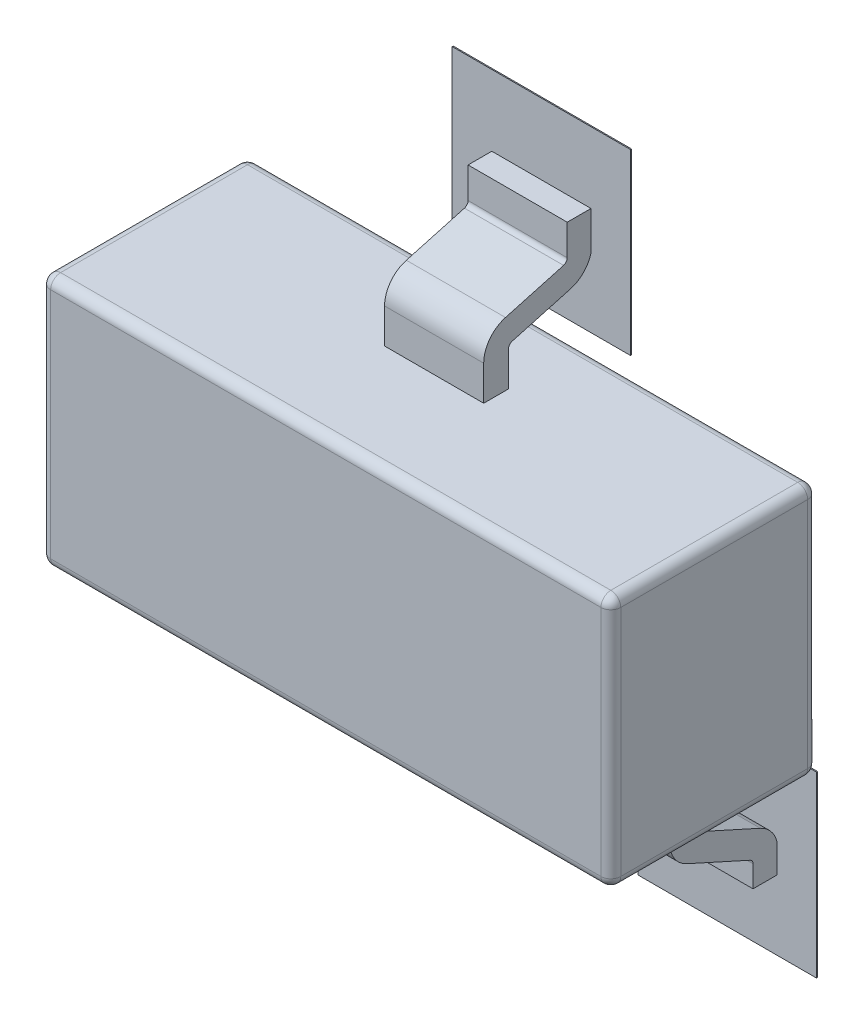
ISO-10303-21;
HEADER;
FILE_DESCRIPTION(('STEP AP214'),'2;1');
FILE_NAME('part.step','',(''),(''),'','','');
FILE_SCHEMA(('AUTOMOTIVE_DESIGN { 1 0 10303 214 1 1 1 1 }'));
ENDSEC;
DATA;
#1=APPLICATION_CONTEXT('core data for automotive mechanical design processes');
#2=APPLICATION_PROTOCOL_DEFINITION('international standard','automotive_design',2000,#1);
#3=PRODUCT_CONTEXT('',#1,'mechanical');
#4=PRODUCT('Part','Part','',(#3));
#5=PRODUCT_RELATED_PRODUCT_CATEGORY('part','',(#4));
#6=PRODUCT_DEFINITION_FORMATION('','',#4);
#7=PRODUCT_DEFINITION_CONTEXT('part definition',#1,'design');
#8=PRODUCT_DEFINITION('design','',#6,#7);
#9=PRODUCT_DEFINITION_SHAPE('','',#8);
#10=(LENGTH_UNIT() NAMED_UNIT(*) SI_UNIT(.MILLI.,.METRE.));
#11=(NAMED_UNIT(*) PLANE_ANGLE_UNIT() SI_UNIT($,.RADIAN.));
#12=(NAMED_UNIT(*) SI_UNIT($,.STERADIAN.) SOLID_ANGLE_UNIT());
#13=UNCERTAINTY_MEASURE_WITH_UNIT(LENGTH_MEASURE(1.E-05),#10,'distance_accuracy_value','');
#14=(GEOMETRIC_REPRESENTATION_CONTEXT(3) GLOBAL_UNCERTAINTY_ASSIGNED_CONTEXT((#13)) GLOBAL_UNIT_ASSIGNED_CONTEXT((#10,
#11,#12)) REPRESENTATION_CONTEXT('',''));
#15=CARTESIAN_POINT('',(0.,0.,0.));
#16=DIRECTION('',(0.,0.,1.));
#17=DIRECTION('',(1.,0.,0.));
#18=AXIS2_PLACEMENT_3D('',#15,#16,#17);
#19=CARTESIAN_POINT('',(1.205992,-1.2450064,0.0762));
#20=DIRECTION('',(0.,0.,-1.));
#21=DIRECTION('',(-1.,0.,0.));
#22=AXIS2_PLACEMENT_3D('',#19,#20,#21);
#23=PLANE('',#22);
#24=DIRECTION('',(1.,0.,0.));
#25=VECTOR('',#24,1.);
#26=CARTESIAN_POINT('',(0.4569968,1.5999968,0.0762));
#27=LINE('',#26,#25);
#28=CARTESIAN_POINT('',(0.4569968,1.5999968,0.0762));
#29=VERTEX_POINT('',#28);
#30=CARTESIAN_POINT('',(-0.4569968,1.5999968,0.0762));
#31=VERTEX_POINT('',#30);
#32=EDGE_CURVE('E717',#29,#31,#27,.F.);
#33=ORIENTED_EDGE('',*,*,#32,.F.);
#34=DIRECTION('',(0.,1.,0.));
#35=VECTOR('',#34,1.);
#36=CARTESIAN_POINT('',(0.4569968,0.6860032,0.0762));
#37=LINE('',#36,#35);
#38=CARTESIAN_POINT('',(0.4569968,0.6860032,0.0762));
#39=VERTEX_POINT('',#38);
#40=EDGE_CURVE('E698',#39,#29,#37,.T.);
#41=ORIENTED_EDGE('',*,*,#40,.F.);
#42=DIRECTION('',(1.,0.,0.));
#43=VECTOR('',#42,1.);
#44=CARTESIAN_POINT('',(-0.4569968,0.6860032,0.0762));
#45=LINE('',#44,#43);
#46=CARTESIAN_POINT('',(-0.4569968,0.6860032,0.0762));
#47=VERTEX_POINT('',#46);
#48=EDGE_CURVE('E707',#47,#39,#45,.T.);
#49=ORIENTED_EDGE('',*,*,#48,.F.);
#50=DIRECTION('',(0.,1.,0.));
#51=VECTOR('',#50,1.);
#52=CARTESIAN_POINT('',(-0.4569968,1.5999968,0.0762));
#53=LINE('',#52,#51);
#54=EDGE_CURVE('E712',#31,#47,#53,.F.);
#55=ORIENTED_EDGE('',*,*,#54,.F.);
#56=EDGE_LOOP('',(#33,#41,#49,#55));
#57=FACE_BOUND('',#56,.T.);
#58=ADVANCED_FACE('F16',(#57),#23,.T.);
#59=CARTESIAN_POINT('',(1.205992,-1.2450064,0.0762));
#60=DIRECTION('',(0.,0.,-1.));
#61=DIRECTION('',(-1.,0.,0.));
#62=AXIS2_PLACEMENT_3D('',#59,#60,#61);
#63=PLANE('',#62);
#64=DIRECTION('',(1.,0.,0.));
#65=VECTOR('',#64,1.);
#66=CARTESIAN_POINT('',(1.4089888,-0.6860032,0.0762));
#67=LINE('',#66,#65);
#68=CARTESIAN_POINT('',(1.4089888,-0.6860032,0.0762));
#69=VERTEX_POINT('',#68);
#70=CARTESIAN_POINT('',(0.4949952,-0.6860032,0.0762));
#71=VERTEX_POINT('',#70);
#72=EDGE_CURVE('E696',#69,#71,#67,.F.);
#73=ORIENTED_EDGE('',*,*,#72,.F.);
#74=DIRECTION('',(0.,1.,0.));
#75=VECTOR('',#74,1.);
#76=CARTESIAN_POINT('',(1.4089888,-1.5999968,0.0762));
#77=LINE('',#76,#75);
#78=CARTESIAN_POINT('',(1.4089888,-1.5999968,0.0762));
#79=VERTEX_POINT('',#78);
#80=EDGE_CURVE('E677',#79,#69,#77,.T.);
#81=ORIENTED_EDGE('',*,*,#80,.F.);
#82=DIRECTION('',(1.,0.,0.));
#83=VECTOR('',#82,1.);
#84=CARTESIAN_POINT('',(0.4949952,-1.5999968,0.0762));
#85=LINE('',#84,#83);
#86=CARTESIAN_POINT('',(0.4949952,-1.5999968,0.0762));
#87=VERTEX_POINT('',#86);
#88=EDGE_CURVE('E686',#87,#79,#85,.T.);
#89=ORIENTED_EDGE('',*,*,#88,.F.);
#90=DIRECTION('',(0.,1.,0.));
#91=VECTOR('',#90,1.);
#92=CARTESIAN_POINT('',(0.4949952,-0.6860032,0.0762));
#93=LINE('',#92,#91);
#94=EDGE_CURVE('E691',#71,#87,#93,.F.);
#95=ORIENTED_EDGE('',*,*,#94,.F.);
#96=EDGE_LOOP('',(#73,#81,#89,#95));
#97=FACE_BOUND('',#96,.T.);
#98=ADVANCED_FACE('F1296',(#97),#63,.T.);
#99=CARTESIAN_POINT('',(1.205992,-1.2450064,0.0762));
#100=DIRECTION('',(0.,0.,-1.));
#101=DIRECTION('',(-1.,0.,0.));
#102=AXIS2_PLACEMENT_3D('',#99,#100,#101);
#103=PLANE('',#102);
#104=DIRECTION('',(1.,0.,0.));
#105=VECTOR('',#104,1.);
#106=CARTESIAN_POINT('',(-0.4949952,-0.6860032,0.0762));
#107=LINE('',#106,#105);
#108=CARTESIAN_POINT('',(-0.4949952,-0.6860032,0.0762));
#109=VERTEX_POINT('',#108);
#110=CARTESIAN_POINT('',(-1.4089888,-0.6860032,0.0762));
#111=VERTEX_POINT('',#110);
#112=EDGE_CURVE('E675',#109,#111,#107,.F.);
#113=ORIENTED_EDGE('',*,*,#112,.F.);
#114=DIRECTION('',(0.,1.,0.));
#115=VECTOR('',#114,1.);
#116=CARTESIAN_POINT('',(-0.4949952,-1.5999968,0.0762));
#117=LINE('',#116,#115);
#118=CARTESIAN_POINT('',(-0.4949952,-1.5999968,0.0762));
#119=VERTEX_POINT('',#118);
#120=EDGE_CURVE('E646',#119,#109,#117,.T.);
#121=ORIENTED_EDGE('',*,*,#120,.F.);
#122=DIRECTION('',(1.,0.,0.));
#123=VECTOR('',#122,1.);
#124=CARTESIAN_POINT('',(-1.4089888,-1.5999968,0.0762));
#125=LINE('',#124,#123);
#126=CARTESIAN_POINT('',(-1.4089888,-1.5999968,0.0762));
#127=VERTEX_POINT('',#126);
#128=EDGE_CURVE('E665',#127,#119,#125,.T.);
#129=ORIENTED_EDGE('',*,*,#128,.F.);
#130=DIRECTION('',(0.,1.,0.));
#131=VECTOR('',#130,1.);
#132=CARTESIAN_POINT('',(-1.4089888,-0.6860032,0.0762));
#133=LINE('',#132,#131);
#134=EDGE_CURVE('E670',#111,#127,#133,.F.);
#135=ORIENTED_EDGE('',*,*,#134,.F.);
#136=EDGE_LOOP('',(#113,#121,#129,#135));
#137=FACE_BOUND('',#136,.T.);
#138=ADVANCED_FACE('F1293',(#137),#103,.T.);
#139=CARTESIAN_POINT('',(0.4569968,1.5999968,0.0762));
#140=DIRECTION('',(0.,1.,0.));
#141=DIRECTION('',(0.,0.,1.));
#142=AXIS2_PLACEMENT_3D('',#139,#140,#141);
#143=PLANE('',#142);
#144=DIRECTION('',(0.,0.,-1.));
#145=VECTOR('',#144,1.);
#146=CARTESIAN_POINT('',(0.4569968,1.5999968,0.0762));
#147=LINE('',#146,#145);
#148=CARTESIAN_POINT('',(0.4569968,1.5999968,0.081534));
#149=VERTEX_POINT('',#148);
#150=EDGE_CURVE('E704',#29,#149,#147,.F.);
#151=ORIENTED_EDGE('',*,*,#150,.F.);
#152=ORIENTED_EDGE('',*,*,#32,.T.);
#153=DIRECTION('',(0.,0.,1.));
#154=VECTOR('',#153,1.);
#155=CARTESIAN_POINT('',(-0.4569968,1.5999968,0.0762));
#156=LINE('',#155,#154);
#157=CARTESIAN_POINT('',(-0.4569968,1.5999968,0.081534));
#158=VERTEX_POINT('',#157);
#159=EDGE_CURVE('E714',#158,#31,#156,.F.);
#160=ORIENTED_EDGE('',*,*,#159,.F.);
#161=DIRECTION('',(1.,0.,0.));
#162=VECTOR('',#161,1.);
#163=CARTESIAN_POINT('',(0.,1.5999968,0.081534));
#164=LINE('',#163,#162);
#165=EDGE_CURVE('E643',#149,#158,#164,.F.);
#166=ORIENTED_EDGE('',*,*,#165,.F.);
#167=EDGE_LOOP('',(#151,#152,#160,#166));
#168=FACE_BOUND('',#167,.T.);
#169=ADVANCED_FACE('F1289',(#168),#143,.T.);
#170=CARTESIAN_POINT('',(-0.4569968,1.5999968,0.0762));
#171=DIRECTION('',(-1.,0.,0.));
#172=DIRECTION('',(0.,0.,1.));
#173=AXIS2_PLACEMENT_3D('',#170,#171,#172);
#174=PLANE('',#173);
#175=ORIENTED_EDGE('',*,*,#159,.T.);
#176=ORIENTED_EDGE('',*,*,#54,.T.);
#177=DIRECTION('',(0.,0.,-1.));
#178=VECTOR('',#177,1.);
#179=CARTESIAN_POINT('',(-0.4569968,0.6860032,0.0762));
#180=LINE('',#179,#178);
#181=CARTESIAN_POINT('',(-0.4569968,0.6860032,0.081534));
#182=VERTEX_POINT('',#181);
#183=EDGE_CURVE('E709',#182,#47,#180,.T.);
#184=ORIENTED_EDGE('',*,*,#183,.F.);
#185=DIRECTION('',(0.,1.,0.));
#186=VECTOR('',#185,1.);
#187=CARTESIAN_POINT('',(-0.4569968,0.,0.081534));
#188=LINE('',#187,#186);
#189=EDGE_CURVE('E640',#158,#182,#188,.F.);
#190=ORIENTED_EDGE('',*,*,#189,.F.);
#191=EDGE_LOOP('',(#175,#176,#184,#190));
#192=FACE_BOUND('',#191,.T.);
#193=ADVANCED_FACE('F1285',(#192),#174,.T.);
#194=CARTESIAN_POINT('',(-0.4569968,0.6860032,0.0762));
#195=DIRECTION('',(0.,-1.,0.));
#196=DIRECTION('',(0.,0.,-1.));
#197=AXIS2_PLACEMENT_3D('',#194,#195,#196);
#198=PLANE('',#197);
#199=ORIENTED_EDGE('',*,*,#183,.T.);
#200=ORIENTED_EDGE('',*,*,#48,.T.);
#201=DIRECTION('',(0.,0.,-1.));
#202=VECTOR('',#201,1.);
#203=CARTESIAN_POINT('',(0.4569968,0.6860032,0.0762));
#204=LINE('',#203,#202);
#205=CARTESIAN_POINT('',(0.4569968,0.6860032,0.081534));
#206=VERTEX_POINT('',#205);
#207=EDGE_CURVE('E701',#206,#39,#204,.T.);
#208=ORIENTED_EDGE('',*,*,#207,.F.);
#209=DIRECTION('',(1.,0.,0.));
#210=VECTOR('',#209,1.);
#211=CARTESIAN_POINT('',(0.,0.6860032,0.081534));
#212=LINE('',#211,#210);
#213=EDGE_CURVE('E637',#182,#206,#212,.T.);
#214=ORIENTED_EDGE('',*,*,#213,.F.);
#215=EDGE_LOOP('',(#199,#200,#208,#214));
#216=FACE_BOUND('',#215,.T.);
#217=ADVANCED_FACE('F1281',(#216),#198,.T.);
#218=CARTESIAN_POINT('',(0.4569968,0.6860032,0.0762));
#219=DIRECTION('',(1.,0.,0.));
#220=DIRECTION('',(0.,0.,-1.));
#221=AXIS2_PLACEMENT_3D('',#218,#219,#220);
#222=PLANE('',#221);
#223=ORIENTED_EDGE('',*,*,#207,.T.);
#224=ORIENTED_EDGE('',*,*,#40,.T.);
#225=ORIENTED_EDGE('',*,*,#150,.T.);
#226=DIRECTION('',(0.,1.,0.));
#227=VECTOR('',#226,1.);
#228=CARTESIAN_POINT('',(0.4569968,0.,0.081534));
#229=LINE('',#228,#227);
#230=EDGE_CURVE('E632',#206,#149,#229,.T.);
#231=ORIENTED_EDGE('',*,*,#230,.F.);
#232=EDGE_LOOP('',(#223,#224,#225,#231));
#233=FACE_BOUND('',#232,.T.);
#234=ADVANCED_FACE('F1277',(#233),#222,.T.);
#235=CARTESIAN_POINT('',(1.4089888,-0.6860032,0.0762));
#236=DIRECTION('',(0.,1.,0.));
#237=DIRECTION('',(0.,0.,1.));
#238=AXIS2_PLACEMENT_3D('',#235,#236,#237);
#239=PLANE('',#238);
#240=DIRECTION('',(0.,0.,-1.));
#241=VECTOR('',#240,1.);
#242=CARTESIAN_POINT('',(1.4089888,-0.6860032,0.0762));
#243=LINE('',#242,#241);
#244=CARTESIAN_POINT('',(1.4089888,-0.6860032,0.081534));
#245=VERTEX_POINT('',#244);
#246=EDGE_CURVE('E683',#69,#245,#243,.F.);
#247=ORIENTED_EDGE('',*,*,#246,.F.);
#248=ORIENTED_EDGE('',*,*,#72,.T.);
#249=DIRECTION('',(0.,0.,1.));
#250=VECTOR('',#249,1.);
#251=CARTESIAN_POINT('',(0.4949952,-0.6860032,0.0762));
#252=LINE('',#251,#250);
#253=CARTESIAN_POINT('',(0.4949952,-0.6860032,0.081534));
#254=VERTEX_POINT('',#253);
#255=EDGE_CURVE('E693',#254,#71,#252,.F.);
#256=ORIENTED_EDGE('',*,*,#255,.F.);
#257=DIRECTION('',(1.,0.,0.));
#258=VECTOR('',#257,1.);
#259=CARTESIAN_POINT('',(0.,-0.6860032,0.081534));
#260=LINE('',#259,#258);
#261=EDGE_CURVE('E1309',#245,#254,#260,.F.);
#262=ORIENTED_EDGE('',*,*,#261,.F.);
#263=EDGE_LOOP('',(#247,#248,#256,#262));
#264=FACE_BOUND('',#263,.T.);
#265=ADVANCED_FACE('F1273',(#264),#239,.T.);
#266=CARTESIAN_POINT('',(0.4949952,-0.6860032,0.0762));
#267=DIRECTION('',(-1.,0.,0.));
#268=DIRECTION('',(0.,0.,1.));
#269=AXIS2_PLACEMENT_3D('',#266,#267,#268);
#270=PLANE('',#269);
#271=ORIENTED_EDGE('',*,*,#255,.T.);
#272=ORIENTED_EDGE('',*,*,#94,.T.);
#273=DIRECTION('',(0.,0.,-1.));
#274=VECTOR('',#273,1.);
#275=CARTESIAN_POINT('',(0.4949952,-1.5999968,0.0762));
#276=LINE('',#275,#274);
#277=CARTESIAN_POINT('',(0.4949952,-1.5999968,0.081534));
#278=VERTEX_POINT('',#277);
#279=EDGE_CURVE('E688',#278,#87,#276,.T.);
#280=ORIENTED_EDGE('',*,*,#279,.F.);
#281=DIRECTION('',(0.,1.,0.));
#282=VECTOR('',#281,1.);
#283=CARTESIAN_POINT('',(0.4949952,0.,0.081534));
#284=LINE('',#283,#282);
#285=EDGE_CURVE('E1318',#254,#278,#284,.F.);
#286=ORIENTED_EDGE('',*,*,#285,.F.);
#287=EDGE_LOOP('',(#271,#272,#280,#286));
#288=FACE_BOUND('',#287,.T.);
#289=ADVANCED_FACE('F1269',(#288),#270,.T.);
#290=CARTESIAN_POINT('',(0.4949952,-1.5999968,0.0762));
#291=DIRECTION('',(0.,-1.,0.));
#292=DIRECTION('',(0.,0.,-1.));
#293=AXIS2_PLACEMENT_3D('',#290,#291,#292);
#294=PLANE('',#293);
#295=ORIENTED_EDGE('',*,*,#279,.T.);
#296=ORIENTED_EDGE('',*,*,#88,.T.);
#297=DIRECTION('',(0.,0.,-1.));
#298=VECTOR('',#297,1.);
#299=CARTESIAN_POINT('',(1.4089888,-1.5999968,0.0762));
#300=LINE('',#299,#298);
#301=CARTESIAN_POINT('',(1.4089888,-1.5999968,0.081534));
#302=VERTEX_POINT('',#301);
#303=EDGE_CURVE('E680',#302,#79,#300,.T.);
#304=ORIENTED_EDGE('',*,*,#303,.F.);
#305=DIRECTION('',(1.,0.,0.));
#306=VECTOR('',#305,1.);
#307=CARTESIAN_POINT('',(0.,-1.5999968,0.081534));
#308=LINE('',#307,#306);
#309=EDGE_CURVE('E1315',#278,#302,#308,.T.);
#310=ORIENTED_EDGE('',*,*,#309,.F.);
#311=EDGE_LOOP('',(#295,#296,#304,#310));
#312=FACE_BOUND('',#311,.T.);
#313=ADVANCED_FACE('F1265',(#312),#294,.T.);
#314=CARTESIAN_POINT('',(1.4089888,-1.5999968,0.0762));
#315=DIRECTION('',(1.,0.,0.));
#316=DIRECTION('',(0.,0.,-1.));
#317=AXIS2_PLACEMENT_3D('',#314,#315,#316);
#318=PLANE('',#317);
#319=ORIENTED_EDGE('',*,*,#303,.T.);
#320=ORIENTED_EDGE('',*,*,#80,.T.);
#321=ORIENTED_EDGE('',*,*,#246,.T.);
#322=DIRECTION('',(0.,1.,0.));
#323=VECTOR('',#322,1.);
#324=CARTESIAN_POINT('',(1.4089888,0.,0.081534));
#325=LINE('',#324,#323);
#326=EDGE_CURVE('E1312',#302,#245,#325,.T.);
#327=ORIENTED_EDGE('',*,*,#326,.F.);
#328=EDGE_LOOP('',(#319,#320,#321,#327));
#329=FACE_BOUND('',#328,.T.);
#330=ADVANCED_FACE('F1261',(#329),#318,.T.);
#331=CARTESIAN_POINT('',(-0.4949952,-0.6860032,0.0762));
#332=DIRECTION('',(0.,1.,0.));
#333=DIRECTION('',(0.,0.,1.));
#334=AXIS2_PLACEMENT_3D('',#331,#332,#333);
#335=PLANE('',#334);
#336=DIRECTION('',(0.,0.,-1.));
#337=VECTOR('',#336,1.);
#338=CARTESIAN_POINT('',(-0.4949952,-0.6860032,0.0762));
#339=LINE('',#338,#337);
#340=CARTESIAN_POINT('',(-0.4949952,-0.6860032,0.081534));
#341=VERTEX_POINT('',#340);
#342=EDGE_CURVE('E662',#109,#341,#339,.F.);
#343=ORIENTED_EDGE('',*,*,#342,.F.);
#344=ORIENTED_EDGE('',*,*,#112,.T.);
#345=DIRECTION('',(0.,0.,1.));
#346=VECTOR('',#345,1.);
#347=CARTESIAN_POINT('',(-1.4089888,-0.6860032,0.0762));
#348=LINE('',#347,#346);
#349=CARTESIAN_POINT('',(-1.4089888,-0.6860032,0.081534));
#350=VERTEX_POINT('',#349);
#351=EDGE_CURVE('E672',#350,#111,#348,.F.);
#352=ORIENTED_EDGE('',*,*,#351,.F.);
#353=DIRECTION('',(1.,0.,0.));
#354=VECTOR('',#353,1.);
#355=CARTESIAN_POINT('',(0.,-0.6860032,0.081534));
#356=LINE('',#355,#354);
#357=EDGE_CURVE('E1331',#341,#350,#356,.F.);
#358=ORIENTED_EDGE('',*,*,#357,.F.);
#359=EDGE_LOOP('',(#343,#344,#352,#358));
#360=FACE_BOUND('',#359,.T.);
#361=ADVANCED_FACE('F1257',(#360),#335,.T.);
#362=CARTESIAN_POINT('',(-1.4089888,-0.6860032,0.0762));
#363=DIRECTION('',(-1.,0.,0.));
#364=DIRECTION('',(0.,0.,1.));
#365=AXIS2_PLACEMENT_3D('',#362,#363,#364);
#366=PLANE('',#365);
#367=ORIENTED_EDGE('',*,*,#351,.T.);
#368=ORIENTED_EDGE('',*,*,#134,.T.);
#369=DIRECTION('',(0.,0.,-1.));
#370=VECTOR('',#369,1.);
#371=CARTESIAN_POINT('',(-1.4089888,-1.5999968,0.0762));
#372=LINE('',#371,#370);
#373=CARTESIAN_POINT('',(-1.4089888,-1.5999968,0.081534));
#374=VERTEX_POINT('',#373);
#375=EDGE_CURVE('E667',#374,#127,#372,.T.);
#376=ORIENTED_EDGE('',*,*,#375,.F.);
#377=DIRECTION('',(0.,1.,0.));
#378=VECTOR('',#377,1.);
#379=CARTESIAN_POINT('',(-1.4089888,0.,0.081534));
#380=LINE('',#379,#378);
#381=EDGE_CURVE('E1431',#350,#374,#380,.F.);
#382=ORIENTED_EDGE('',*,*,#381,.F.);
#383=EDGE_LOOP('',(#367,#368,#376,#382));
#384=FACE_BOUND('',#383,.T.);
#385=ADVANCED_FACE('F1254',(#384),#366,.T.);
#386=CARTESIAN_POINT('',(-1.4089888,-1.5999968,0.0762));
#387=DIRECTION('',(0.,-1.,0.));
#388=DIRECTION('',(0.,0.,-1.));
#389=AXIS2_PLACEMENT_3D('',#386,#387,#388);
#390=PLANE('',#389);
#391=ORIENTED_EDGE('',*,*,#375,.T.);
#392=ORIENTED_EDGE('',*,*,#128,.T.);
#393=DIRECTION('',(0.,0.,-1.));
#394=VECTOR('',#393,1.);
#395=CARTESIAN_POINT('',(-0.4949952,-1.5999968,0.0762));
#396=LINE('',#395,#394);
#397=CARTESIAN_POINT('',(-0.4949952,-1.5999968,0.081534));
#398=VERTEX_POINT('',#397);
#399=EDGE_CURVE('E60',#398,#119,#396,.T.);
#400=ORIENTED_EDGE('',*,*,#399,.F.);
#401=DIRECTION('',(1.,0.,0.));
#402=VECTOR('',#401,1.);
#403=CARTESIAN_POINT('',(0.,-1.5999968,0.081534));
#404=LINE('',#403,#402);
#405=EDGE_CURVE('E1428',#374,#398,#404,.T.);
#406=ORIENTED_EDGE('',*,*,#405,.F.);
#407=EDGE_LOOP('',(#391,#392,#400,#406));
#408=FACE_BOUND('',#407,.T.);
#409=ADVANCED_FACE('F1250',(#408),#390,.T.);
#410=CARTESIAN_POINT('',(-0.4949952,-1.5999968,0.0762));
#411=DIRECTION('',(1.,0.,0.));
#412=DIRECTION('',(0.,0.,-1.));
#413=AXIS2_PLACEMENT_3D('',#410,#411,#412);
#414=PLANE('',#413);
#415=ORIENTED_EDGE('',*,*,#399,.T.);
#416=ORIENTED_EDGE('',*,*,#120,.T.);
#417=ORIENTED_EDGE('',*,*,#342,.T.);
#418=DIRECTION('',(0.,1.,0.));
#419=VECTOR('',#418,1.);
#420=CARTESIAN_POINT('',(-0.4949952,0.,0.081534));
#421=LINE('',#420,#419);
#422=EDGE_CURVE('E1425',#398,#341,#421,.T.);
#423=ORIENTED_EDGE('',*,*,#422,.F.);
#424=EDGE_LOOP('',(#415,#416,#417,#423));
#425=FACE_BOUND('',#424,.T.);
#426=ADVANCED_FACE('F1246',(#425),#414,.T.);
#427=CARTESIAN_POINT('',(0.,0.,0.081534));
#428=DIRECTION('',(0.,0.,1.));
#429=DIRECTION('',(1.,0.,0.));
#430=AXIS2_PLACEMENT_3D('',#427,#428,#429);
#431=PLANE('',#430);
#432=DIRECTION('',(1.,0.,0.));
#433=VECTOR('',#432,1.);
#434=CARTESIAN_POINT('',(-0.254,1.03930683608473,0.0815339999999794));
#435=LINE('',#434,#433);
#436=CARTESIAN_POINT('',(-0.254,1.03930683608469,0.0815339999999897));
#437=VERTEX_POINT('',#436);
#438=CARTESIAN_POINT('',(0.254,1.03930683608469,0.0815339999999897));
#439=VERTEX_POINT('',#438);
#440=EDGE_CURVE('E579',#437,#439,#435,.T.);
#441=ORIENTED_EDGE('',*,*,#440,.F.);
#442=DIRECTION('',(0.,1.,0.));
#443=VECTOR('',#442,1.);
#444=CARTESIAN_POINT('',(-0.254,0.,0.081534));
#445=LINE('',#444,#443);
#446=CARTESIAN_POINT('',(-0.254,1.23720111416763,0.081534));
#447=VERTEX_POINT('',#446);
#448=EDGE_CURVE('E611',#437,#447,#445,.T.);
#449=ORIENTED_EDGE('',*,*,#448,.T.);
#450=DIRECTION('',(1.,0.,0.));
#451=VECTOR('',#450,1.);
#452=CARTESIAN_POINT('',(-0.254,1.23720111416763,0.081534));
#453=LINE('',#452,#451);
#454=CARTESIAN_POINT('',(0.254,1.23720111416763,0.081534));
#455=VERTEX_POINT('',#454);
#456=EDGE_CURVE('E622',#455,#447,#453,.F.);
#457=ORIENTED_EDGE('',*,*,#456,.F.);
#458=DIRECTION('',(0.,1.,0.));
#459=VECTOR('',#458,1.);
#460=CARTESIAN_POINT('',(0.254,0.,0.081534));
#461=LINE('',#460,#459);
#462=EDGE_CURVE('E649',#439,#455,#461,.T.);
#463=ORIENTED_EDGE('',*,*,#462,.F.);
#464=EDGE_LOOP('',(#441,#449,#457,#463));
#465=FACE_BOUND('',#464,.T.);
#466=ORIENTED_EDGE('',*,*,#213,.T.);
#467=ORIENTED_EDGE('',*,*,#230,.T.);
#468=ORIENTED_EDGE('',*,*,#165,.T.);
#469=ORIENTED_EDGE('',*,*,#189,.T.);
#470=EDGE_LOOP('',(#466,#467,#468,#469));
#471=FACE_BOUND('',#470,.T.);
#472=ADVANCED_FACE('F1242',(#465,#471),#431,.T.);
#473=CARTESIAN_POINT('',(-0.254,1.23720111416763,0.0762));
#474=DIRECTION('',(0.,1.,0.));
#475=DIRECTION('',(0.,0.,1.));
#476=AXIS2_PLACEMENT_3D('',#473,#474,#475);
#477=PLANE('',#476);
#478=DIRECTION('',(0.,0.,-1.));
#479=VECTOR('',#478,1.);
#480=CARTESIAN_POINT('',(0.254,1.23720111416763,0.));
#481=LINE('',#480,#479);
#482=CARTESIAN_POINT('',(0.254,1.23720111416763,0.2032));
#483=VERTEX_POINT('',#482);
#484=EDGE_CURVE('E450',#455,#483,#481,.F.);
#485=ORIENTED_EDGE('',*,*,#484,.F.);
#486=ORIENTED_EDGE('',*,*,#456,.T.);
#487=DIRECTION('',(0.,0.,-1.));
#488=VECTOR('',#487,1.);
#489=CARTESIAN_POINT('',(-0.254,1.23720111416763,0.));
#490=LINE('',#489,#488);
#491=CARTESIAN_POINT('',(-0.254,1.23720111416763,0.2032));
#492=VERTEX_POINT('',#491);
#493=EDGE_CURVE('E625',#447,#492,#490,.F.);
#494=ORIENTED_EDGE('',*,*,#493,.T.);
#495=DIRECTION('',(1.,0.,0.));
#496=VECTOR('',#495,1.);
#497=CARTESIAN_POINT('',(-0.254,1.23720111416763,0.2032));
#498=LINE('',#497,#496);
#499=EDGE_CURVE('E619',#483,#492,#498,.F.);
#500=ORIENTED_EDGE('',*,*,#499,.F.);
#501=EDGE_LOOP('',(#485,#486,#494,#500));
#502=FACE_BOUND('',#501,.T.);
#503=ADVANCED_FACE('F1239',(#502),#477,.T.);
#504=CARTESIAN_POINT('',(-0.254,1.23720111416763,0.2032));
#505=DIRECTION('',(0.,0.,1.));
#506=DIRECTION('',(1.,0.,0.));
#507=AXIS2_PLACEMENT_3D('',#504,#505,#506);
#508=PLANE('',#507);
#509=ORIENTED_EDGE('',*,*,#499,.T.);
#510=DIRECTION('',(0.,1.,0.));
#511=VECTOR('',#510,1.);
#512=CARTESIAN_POINT('',(-0.254,0.,0.2032));
#513=LINE('',#512,#511);
#514=CARTESIAN_POINT('',(-0.254,1.0792737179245,0.2032));
#515=VERTEX_POINT('',#514);
#516=EDGE_CURVE('E627',#492,#515,#513,.F.);
#517=ORIENTED_EDGE('',*,*,#516,.T.);
#518=DIRECTION('',(1.,0.,0.));
#519=VECTOR('',#518,1.);
#520=CARTESIAN_POINT('',(-0.254,1.0792737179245,0.2032));
#521=LINE('',#520,#519);
#522=CARTESIAN_POINT('',(0.254,1.0792737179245,0.2032));
#523=VERTEX_POINT('',#522);
#524=EDGE_CURVE('E420',#515,#523,#521,.T.);
#525=ORIENTED_EDGE('',*,*,#524,.T.);
#526=DIRECTION('',(0.,1.,0.));
#527=VECTOR('',#526,1.);
#528=CARTESIAN_POINT('',(0.254,0.,0.2032));
#529=LINE('',#528,#527);
#530=EDGE_CURVE('E448',#483,#523,#529,.F.);
#531=ORIENTED_EDGE('',*,*,#530,.F.);
#532=EDGE_LOOP('',(#509,#517,#525,#531));
#533=FACE_BOUND('',#532,.T.);
#534=ADVANCED_FACE('F1236',(#533),#508,.T.);
#535=CARTESIAN_POINT('',(-0.254,1.0792737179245,0.2286));
#536=DIRECTION('',(1.,0.,0.));
#537=DIRECTION('',(0.,0.,-1.));
#538=AXIS2_PLACEMENT_3D('',#535,#536,#537);
#539=CYLINDRICAL_SURFACE('',#538,0.0254);
#540=CARTESIAN_POINT('',(0.254,1.0792737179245,0.2286));
#541=DIRECTION('',(1.,0.,0.));
#542=DIRECTION('',(0.,0.,-1.));
#543=AXIS2_PLACEMENT_3D('',#540,#541,#542);
#544=CIRCLE('',#543,0.0254);
#545=CARTESIAN_POINT('',(0.254,1.05479495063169,0.221821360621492));
#546=VERTEX_POINT('',#545);
#547=EDGE_CURVE('E429',#523,#546,#544,.F.);
#548=ORIENTED_EDGE('',*,*,#547,.F.);
#549=ORIENTED_EDGE('',*,*,#524,.F.);
#550=CARTESIAN_POINT('',(-0.254,1.0792737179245,0.2286));
#551=DIRECTION('',(1.,0.,0.));
#552=DIRECTION('',(0.,0.,-1.));
#553=AXIS2_PLACEMENT_3D('',#550,#551,#552);
#554=CIRCLE('',#553,0.0254);
#555=CARTESIAN_POINT('',(-0.254,1.05479495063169,0.221821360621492));
#556=VERTEX_POINT('',#555);
#557=EDGE_CURVE('E432',#515,#556,#554,.F.);
#558=ORIENTED_EDGE('',*,*,#557,.T.);
#559=DIRECTION('',(1.,0.,0.));
#560=VECTOR('',#559,1.);
#561=CARTESIAN_POINT('',(-0.254,1.05479495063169,0.221821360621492));
#562=LINE('',#561,#560);
#563=EDGE_CURVE('E425',#546,#556,#562,.F.);
#564=ORIENTED_EDGE('',*,*,#563,.F.);
#565=EDGE_LOOP('',(#548,#549,#558,#564));
#566=FACE_BOUND('',#565,.T.);
#567=ADVANCED_FACE('F427',(#566),#539,.F.);
#568=CARTESIAN_POINT('',(-0.254,1.05479495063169,0.221821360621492));
#569=DIRECTION('',(0.,0.963730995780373,0.266875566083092));
#570=DIRECTION('',(0.,-0.266875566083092,0.963730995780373));
#571=AXIS2_PLACEMENT_3D('',#568,#569,#570);
#572=PLANE('',#571);
#573=ORIENTED_EDGE('',*,*,#563,.T.);
#574=DIRECTION('',(0.,-0.26687556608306,0.963730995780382));
#575=VECTOR('',#574,1.);
#576=CARTESIAN_POINT('',(-0.254,1.05479495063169,0.221821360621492));
#577=LINE('',#576,#575);
#578=CARTESIAN_POINT('',(-0.254,0.972372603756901,0.519461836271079));
#579=VERTEX_POINT('',#578);
#580=EDGE_CURVE('E870',#556,#579,#577,.T.);
#581=ORIENTED_EDGE('',*,*,#580,.T.);
#582=DIRECTION('',(1.,0.,0.));
#583=VECTOR('',#582,1.);
#584=CARTESIAN_POINT('',(-0.254,0.972372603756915,0.519461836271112));
#585=LINE('',#584,#583);
#586=CARTESIAN_POINT('',(0.254,0.972372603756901,0.519461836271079));
#587=VERTEX_POINT('',#586);
#588=EDGE_CURVE('E435',#587,#579,#585,.F.);
#589=ORIENTED_EDGE('',*,*,#588,.F.);
#590=DIRECTION('',(0.,-0.26687556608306,0.963730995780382));
#591=VECTOR('',#590,1.);
#592=CARTESIAN_POINT('',(0.254,1.05479495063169,0.221821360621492));
#593=LINE('',#592,#591);
#594=EDGE_CURVE('E438',#546,#587,#593,.T.);
#595=ORIENTED_EDGE('',*,*,#594,.F.);
#596=EDGE_LOOP('',(#573,#581,#589,#595));
#597=FACE_BOUND('',#596,.T.);
#598=ADVANCED_FACE('F439',(#597),#572,.T.);
#599=CARTESIAN_POINT('',(-0.254,0.8255,0.47879));
#600=DIRECTION('',(1.,0.,0.));
#601=DIRECTION('',(0.,0.,-1.));
#602=AXIS2_PLACEMENT_3D('',#599,#600,#601);
#603=CYLINDRICAL_SURFACE('',#602,0.1524);
#604=ORIENTED_EDGE('',*,*,#588,.T.);
#605=CARTESIAN_POINT('',(-0.254,0.8255,0.47879));
#606=DIRECTION('',(1.,0.,0.));
#607=DIRECTION('',(0.,0.,-1.));
#608=AXIS2_PLACEMENT_3D('',#605,#606,#607);
#609=CIRCLE('',#608,0.1524);
#610=CARTESIAN_POINT('',(-0.254,0.8255,0.63119));
#611=VERTEX_POINT('',#610);
#612=EDGE_CURVE('E867',#579,#611,#609,.T.);
#613=ORIENTED_EDGE('',*,*,#612,.T.);
#614=DIRECTION('',(1.,0.,0.));
#615=VECTOR('',#614,1.);
#616=CARTESIAN_POINT('',(-0.254,0.8255,0.63119));
#617=LINE('',#616,#615);
#618=CARTESIAN_POINT('',(0.254,0.8255,0.63119));
#619=VERTEX_POINT('',#618);
#620=EDGE_CURVE('E608',#619,#611,#617,.F.);
#621=ORIENTED_EDGE('',*,*,#620,.F.);
#622=CARTESIAN_POINT('',(0.254,0.8255,0.47879));
#623=DIRECTION('',(1.,0.,0.));
#624=DIRECTION('',(0.,0.,-1.));
#625=AXIS2_PLACEMENT_3D('',#622,#623,#624);
#626=CIRCLE('',#625,0.1524);
#627=EDGE_CURVE('E443',#587,#619,#626,.T.);
#628=ORIENTED_EDGE('',*,*,#627,.F.);
#629=EDGE_LOOP('',(#604,#613,#621,#628));
#630=FACE_BOUND('',#629,.T.);
#631=ADVANCED_FACE('F1227',(#630),#603,.T.);
#632=CARTESIAN_POINT('',(-0.254,0.8255,0.47879));
#633=DIRECTION('',(1.,0.,0.));
#634=DIRECTION('',(0.,0.,-1.));
#635=AXIS2_PLACEMENT_3D('',#632,#633,#634);
#636=CYLINDRICAL_SURFACE('',#635,0.0254);
#637=CARTESIAN_POINT('',(0.254,0.8255,0.47879));
#638=DIRECTION('',(1.,0.,0.));
#639=DIRECTION('',(0.,0.,-1.));
#640=AXIS2_PLACEMENT_3D('',#637,#638,#639);
#641=CIRCLE('',#640,0.0254);
#642=CARTESIAN_POINT('',(0.254,0.8255,0.50419));
#643=VERTEX_POINT('',#642);
#644=CARTESIAN_POINT('',(0.254,0.849978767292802,0.485568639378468));
#645=VERTEX_POINT('',#644);
#646=EDGE_CURVE('E874',#643,#645,#641,.F.);
#647=ORIENTED_EDGE('',*,*,#646,.F.);
#648=DIRECTION('',(-1.,0.,0.));
#649=VECTOR('',#648,1.);
#650=CARTESIAN_POINT('',(-0.254,0.8255,0.50419));
#651=LINE('',#650,#649);
#652=CARTESIAN_POINT('',(-0.254,0.8255,0.50419));
#653=VERTEX_POINT('',#652);
#654=EDGE_CURVE('E458',#653,#643,#651,.F.);
#655=ORIENTED_EDGE('',*,*,#654,.F.);
#656=CARTESIAN_POINT('',(-0.254,0.8255,0.47879));
#657=DIRECTION('',(1.,0.,0.));
#658=DIRECTION('',(0.,0.,-1.));
#659=AXIS2_PLACEMENT_3D('',#656,#657,#658);
#660=CIRCLE('',#659,0.0254);
#661=CARTESIAN_POINT('',(-0.254,0.849978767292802,0.485568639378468));
#662=VERTEX_POINT('',#661);
#663=EDGE_CURVE('E864',#653,#662,#660,.F.);
#664=ORIENTED_EDGE('',*,*,#663,.T.);
#665=DIRECTION('',(1.,0.,0.));
#666=VECTOR('',#665,1.);
#667=CARTESIAN_POINT('',(-0.254,0.849978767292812,0.485568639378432));
#668=LINE('',#667,#666);
#669=EDGE_CURVE('E589',#645,#662,#668,.F.);
#670=ORIENTED_EDGE('',*,*,#669,.F.);
#671=EDGE_LOOP('',(#647,#655,#664,#670));
#672=FACE_BOUND('',#671,.T.);
#673=ADVANCED_FACE('F1221',(#672),#636,.F.);
#674=CARTESIAN_POINT('',(-0.254,0.849978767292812,0.485568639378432));
#675=DIRECTION('',(0.,-0.963730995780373,-0.266875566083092));
#676=DIRECTION('',(0.,0.266875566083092,-0.963730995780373));
#677=AXIS2_PLACEMENT_3D('',#674,#675,#676);
#678=PLANE('',#677);
#679=ORIENTED_EDGE('',*,*,#669,.T.);
#680=DIRECTION('',(0.,0.266875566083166,-0.963730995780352));
#681=VECTOR('',#680,1.);
#682=CARTESIAN_POINT('',(-0.254,0.849978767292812,0.485568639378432));
#683=LINE('',#682,#681);
#684=CARTESIAN_POINT('',(-0.254,0.932401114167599,0.187928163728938));
#685=VERTEX_POINT('',#684);
#686=EDGE_CURVE('E863',#662,#685,#683,.T.);
#687=ORIENTED_EDGE('',*,*,#686,.T.);
#688=DIRECTION('',(1.,0.,0.));
#689=VECTOR('',#688,1.);
#690=CARTESIAN_POINT('',(-0.254,0.93240111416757,0.187928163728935));
#691=LINE('',#690,#689);
#692=CARTESIAN_POINT('',(0.254,0.932401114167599,0.187928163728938));
#693=VERTEX_POINT('',#692);
#694=EDGE_CURVE('E586',#693,#685,#691,.F.);
#695=ORIENTED_EDGE('',*,*,#694,.F.);
#696=DIRECTION('',(0.,0.266875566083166,-0.963730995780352));
#697=VECTOR('',#696,1.);
#698=CARTESIAN_POINT('',(0.254,0.849978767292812,0.485568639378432));
#699=LINE('',#698,#697);
#700=EDGE_CURVE('E873',#645,#693,#699,.T.);
#701=ORIENTED_EDGE('',*,*,#700,.F.);
#702=EDGE_LOOP('',(#679,#687,#695,#701));
#703=FACE_BOUND('',#702,.T.);
#704=ADVANCED_FACE('F1216',(#703),#678,.T.);
#705=CARTESIAN_POINT('',(-0.254,1.0792737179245,0.2286));
#706=DIRECTION('',(1.,0.,0.));
#707=DIRECTION('',(0.,0.,-1.));
#708=AXIS2_PLACEMENT_3D('',#705,#706,#707);
#709=CYLINDRICAL_SURFACE('',#708,0.1524);
#710=CARTESIAN_POINT('',(-0.254,1.0792737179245,0.2286));
#711=DIRECTION('',(1.,0.,0.));
#712=DIRECTION('',(0.,0.,-1.));
#713=AXIS2_PLACEMENT_3D('',#710,#711,#712);
#714=CIRCLE('',#713,0.1524);
#715=EDGE_CURVE('E860',#685,#437,#714,.T.);
#716=ORIENTED_EDGE('',*,*,#715,.T.);
#717=ORIENTED_EDGE('',*,*,#440,.T.);
#718=CARTESIAN_POINT('',(0.254,1.0792737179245,0.2286));
#719=DIRECTION('',(1.,0.,0.));
#720=DIRECTION('',(0.,0.,-1.));
#721=AXIS2_PLACEMENT_3D('',#718,#719,#720);
#722=CIRCLE('',#721,0.1524);
#723=EDGE_CURVE('E872',#693,#439,#722,.T.);
#724=ORIENTED_EDGE('',*,*,#723,.F.);
#725=ORIENTED_EDGE('',*,*,#694,.T.);
#726=EDGE_LOOP('',(#716,#717,#724,#725));
#727=FACE_BOUND('',#726,.T.);
#728=ADVANCED_FACE('F1212',(#727),#709,.T.);
#729=CARTESIAN_POINT('',(-1.4097,0.5969,0.1778));
#730=DIRECTION('',(-0.707106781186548,0.,-0.707106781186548));
#731=DIRECTION('',(0.,1.,0.));
#732=AXIS2_PLACEMENT_3D('',#729,#730,#731);
#733=SPHERICAL_SURFACE('',#732,0.0508);
#734=CARTESIAN_POINT('',(-1.4097,0.5969,0.1778));
#735=DIRECTION('',(0.,-1.,0.));
#736=DIRECTION('',(0.,0.,-1.));
#737=AXIS2_PLACEMENT_3D('',#734,#735,#736);
#738=CIRCLE('',#737,0.0508);
#739=CARTESIAN_POINT('',(-1.4605,0.5969,0.1778));
#740=VERTEX_POINT('',#739);
#741=CARTESIAN_POINT('',(-1.44562102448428,0.5969,0.141878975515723));
#742=VERTEX_POINT('',#741);
#743=EDGE_CURVE('E856',#740,#742,#738,.T.);
#744=ORIENTED_EDGE('',*,*,#743,.F.);
#745=CARTESIAN_POINT('',(-1.4097,0.5969,0.1778));
#746=DIRECTION('',(0.,0.,-1.));
#747=DIRECTION('',(-1.,0.,0.));
#748=AXIS2_PLACEMENT_3D('',#745,#746,#747);
#749=CIRCLE('',#748,0.0508);
#750=CARTESIAN_POINT('',(-1.4097,0.6477,0.1778));
#751=VERTEX_POINT('',#750);
#752=EDGE_CURVE('E857',#751,#740,#749,.F.);
#753=ORIENTED_EDGE('',*,*,#752,.F.);
#754=CARTESIAN_POINT('',(-1.4097,0.5969,0.1778));
#755=DIRECTION('',(-1.,0.,0.));
#756=DIRECTION('',(0.,0.,1.));
#757=AXIS2_PLACEMENT_3D('',#754,#755,#756);
#758=CIRCLE('',#757,0.0508);
#759=CARTESIAN_POINT('',(-1.4097,0.5969,0.127));
#760=VERTEX_POINT('',#759);
#761=EDGE_CURVE('E19',#760,#751,#758,.F.);
#762=ORIENTED_EDGE('',*,*,#761,.F.);
#763=CARTESIAN_POINT('',(-1.4097,0.5969,0.1778));
#764=DIRECTION('',(0.,-1.,0.));
#765=DIRECTION('',(0.,0.,-1.));
#766=AXIS2_PLACEMENT_3D('',#763,#764,#765);
#767=CIRCLE('',#766,0.0508);
#768=EDGE_CURVE('E583',#742,#760,#767,.T.);
#769=ORIENTED_EDGE('',*,*,#768,.F.);
#770=EDGE_LOOP('',(#744,#753,#762,#769));
#771=FACE_BOUND('',#770,.T.);
#772=ADVANCED_FACE('F562',(#771),#733,.T.);
#773=CARTESIAN_POINT('',(-1.4097,-0.5969,0.1778));
#774=DIRECTION('',(0.,-0.707106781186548,-0.707106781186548));
#775=DIRECTION('',(-1.,0.,0.));
#776=AXIS2_PLACEMENT_3D('',#773,#774,#775);
#777=SPHERICAL_SURFACE('',#776,0.0508);
#778=CARTESIAN_POINT('',(-1.4097,-0.5969,0.1778));
#779=DIRECTION('',(1.,0.,0.));
#780=DIRECTION('',(0.,0.,-1.));
#781=AXIS2_PLACEMENT_3D('',#778,#779,#780);
#782=CIRCLE('',#781,0.0508);
#783=CARTESIAN_POINT('',(-1.4097,-0.632821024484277,0.141878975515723));
#784=VERTEX_POINT('',#783);
#785=CARTESIAN_POINT('',(-1.4097,-0.5969,0.127));
#786=VERTEX_POINT('',#785);
#787=EDGE_CURVE('E575',#784,#786,#782,.T.);
#788=ORIENTED_EDGE('',*,*,#787,.F.);
#789=CARTESIAN_POINT('',(-1.4097,-0.5969,0.1778));
#790=DIRECTION('',(1.,0.,0.));
#791=DIRECTION('',(0.,0.,-1.));
#792=AXIS2_PLACEMENT_3D('',#789,#790,#791);
#793=CIRCLE('',#792,0.0508);
#794=CARTESIAN_POINT('',(-1.4097,-0.6477,0.1778));
#795=VERTEX_POINT('',#794);
#796=EDGE_CURVE('E846',#795,#784,#793,.T.);
#797=ORIENTED_EDGE('',*,*,#796,.F.);
#798=CARTESIAN_POINT('',(-1.4097,-0.5969,0.1778));
#799=DIRECTION('',(0.,0.,-1.));
#800=DIRECTION('',(-1.,0.,0.));
#801=AXIS2_PLACEMENT_3D('',#798,#799,#800);
#802=CIRCLE('',#801,0.0508);
#803=CARTESIAN_POINT('',(-1.4605,-0.5969,0.1778));
#804=VERTEX_POINT('',#803);
#805=EDGE_CURVE('E850',#804,#795,#802,.F.);
#806=ORIENTED_EDGE('',*,*,#805,.F.);
#807=CARTESIAN_POINT('',(-1.4097,-0.5969,0.1778));
#808=DIRECTION('',(0.,-1.,0.));
#809=DIRECTION('',(0.,0.,-1.));
#810=AXIS2_PLACEMENT_3D('',#807,#808,#809);
#811=CIRCLE('',#810,0.0508);
#812=EDGE_CURVE('E582',#786,#804,#811,.F.);
#813=ORIENTED_EDGE('',*,*,#812,.F.);
#814=EDGE_LOOP('',(#788,#797,#806,#813));
#815=FACE_BOUND('',#814,.T.);
#816=ADVANCED_FACE('F557',(#815),#777,.T.);
#817=CARTESIAN_POINT('',(0.,0.,0.127));
#818=DIRECTION('',(0.,0.,1.));
#819=DIRECTION('',(1.,0.,0.));
#820=AXIS2_PLACEMENT_3D('',#817,#818,#819);
#821=PLANE('',#820);
#822=DIRECTION('',(0.,1.,0.));
#823=VECTOR('',#822,1.);
#824=CARTESIAN_POINT('',(1.4097,0.,0.127));
#825=LINE('',#824,#823);
#826=CARTESIAN_POINT('',(1.4097,-0.5969,0.127));
#827=VERTEX_POINT('',#826);
#828=CARTESIAN_POINT('',(1.4097,0.5969,0.127));
#829=VERTEX_POINT('',#828);
#830=EDGE_CURVE('E576',#827,#829,#825,.T.);
#831=ORIENTED_EDGE('',*,*,#830,.F.);
#832=DIRECTION('',(1.,0.,0.));
#833=VECTOR('',#832,1.);
#834=CARTESIAN_POINT('',(-5.4973728,-0.5969,0.127));
#835=LINE('',#834,#833);
#836=EDGE_CURVE('E571',#786,#827,#835,.T.);
#837=ORIENTED_EDGE('',*,*,#836,.F.);
#838=DIRECTION('',(0.,-1.,0.));
#839=VECTOR('',#838,1.);
#840=CARTESIAN_POINT('',(-1.4097,5.77150845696,0.127));
#841=LINE('',#840,#839);
#842=EDGE_CURVE('E580',#760,#786,#841,.T.);
#843=ORIENTED_EDGE('',*,*,#842,.F.);
#844=DIRECTION('',(-1.,0.,0.));
#845=VECTOR('',#844,1.);
#846=CARTESIAN_POINT('',(5.4973728,0.5969,0.127));
#847=LINE('',#846,#845);
#848=EDGE_CURVE('E454',#829,#760,#847,.T.);
#849=ORIENTED_EDGE('',*,*,#848,.F.);
#850=EDGE_LOOP('',(#831,#837,#843,#849));
#851=FACE_BOUND('',#850,.T.);
#852=ADVANCED_FACE('F553',(#851),#821,.F.);
#853=CARTESIAN_POINT('',(1.205992,-1.13369131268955,0.2286));
#854=DIRECTION('',(1.,0.,0.));
#855=DIRECTION('',(0.,0.,-1.));
#856=AXIS2_PLACEMENT_3D('',#853,#854,#855);
#857=CYLINDRICAL_SURFACE('',#856,0.1524);
#858=CARTESIAN_POINT('',(1.205992,-1.13369131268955,0.2286));
#859=DIRECTION('',(1.,0.,0.));
#860=DIRECTION('',(0.,0.,-1.));
#861=AXIS2_PLACEMENT_3D('',#858,#859,#860);
#862=CIRCLE('',#861,0.1524);
#863=CARTESIAN_POINT('',(1.205992,-1.09372443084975,0.081534));
#864=VERTEX_POINT('',#863);
#865=CARTESIAN_POINT('',(1.205992,-0.994816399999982,0.165834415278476));
#866=VERTEX_POINT('',#865);
#867=EDGE_CURVE('E827',#864,#866,#862,.T.);
#868=ORIENTED_EDGE('',*,*,#867,.F.);
#869=DIRECTION('',(1.,0.,0.));
#870=VECTOR('',#869,1.);
#871=CARTESIAN_POINT('',(0.,-1.09372443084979,0.081534));
#872=LINE('',#871,#870);
#873=CARTESIAN_POINT('',(0.697992,-1.09372443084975,0.081534));
#874=VERTEX_POINT('',#873);
#875=EDGE_CURVE('E1328',#874,#864,#872,.T.);
#876=ORIENTED_EDGE('',*,*,#875,.F.);
#877=CARTESIAN_POINT('',(0.697992,-1.13369131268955,0.2286));
#878=DIRECTION('',(1.,0.,0.));
#879=DIRECTION('',(0.,0.,-1.));
#880=AXIS2_PLACEMENT_3D('',#877,#878,#879);
#881=CIRCLE('',#880,0.1524);
#882=CARTESIAN_POINT('',(0.697992,-0.994816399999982,0.165834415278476));
#883=VERTEX_POINT('',#882);
#884=EDGE_CURVE('E841',#874,#883,#881,.T.);
#885=ORIENTED_EDGE('',*,*,#884,.T.);
#886=DIRECTION('',(1.,0.,0.));
#887=VECTOR('',#886,1.);
#888=CARTESIAN_POINT('',(1.205992,-0.9948164,0.165834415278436));
#889=LINE('',#888,#887);
#890=EDGE_CURVE('E578',#866,#883,#889,.F.);
#891=ORIENTED_EDGE('',*,*,#890,.F.);
#892=EDGE_LOOP('',(#868,#876,#885,#891));
#893=FACE_BOUND('',#892,.T.);
#894=ADVANCED_FACE('F549',(#893),#857,.T.);
#895=CARTESIAN_POINT('',(1.205992,-0.9948164,0.165834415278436));
#896=DIRECTION('',(0.,0.911252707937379,-0.41184766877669));
#897=DIRECTION('',(0.,0.41184766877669,0.911252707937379));
#898=AXIS2_PLACEMENT_3D('',#895,#896,#897);
#899=PLANE('',#898);
#900=DIRECTION('',(1.,0.,0.));
#901=VECTOR('',#900,1.);
#902=CARTESIAN_POINT('',(1.205992,-0.848645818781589,0.489250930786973));
#903=LINE('',#902,#901);
#904=CARTESIAN_POINT('',(0.697992,-0.848645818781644,0.489250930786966));
#905=VERTEX_POINT('',#904);
#906=CARTESIAN_POINT('',(1.205992,-0.848645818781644,0.489250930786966));
#907=VERTEX_POINT('',#906);
#908=EDGE_CURVE('E1349',#905,#907,#903,.T.);
#909=ORIENTED_EDGE('',*,*,#908,.T.);
#910=DIRECTION('',(0.,0.41184766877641,0.911252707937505));
#911=VECTOR('',#910,1.);
#912=CARTESIAN_POINT('',(1.205992,-0.9948164,0.165834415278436));
#913=LINE('',#912,#911);
#914=EDGE_CURVE('E826',#866,#907,#913,.T.);
#915=ORIENTED_EDGE('',*,*,#914,.F.);
#916=ORIENTED_EDGE('',*,*,#890,.T.);
#917=DIRECTION('',(0.,0.41184766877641,0.911252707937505));
#918=VECTOR('',#917,1.);
#919=CARTESIAN_POINT('',(0.697992,-0.9948164,0.165834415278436));
#920=LINE('',#919,#918);
#921=EDGE_CURVE('E840',#883,#905,#920,.T.);
#922=ORIENTED_EDGE('',*,*,#921,.T.);
#923=EDGE_LOOP('',(#909,#915,#916,#922));
#924=FACE_BOUND('',#923,.T.);
#925=ADVANCED_FACE('F545',(#924),#899,.T.);
#926=CARTESIAN_POINT('',(1.205992,-0.8255,0.47879));
#927=DIRECTION('',(1.,0.,0.));
#928=DIRECTION('',(0.,0.,-1.));
#929=AXIS2_PLACEMENT_3D('',#926,#927,#928);
#930=CYLINDRICAL_SURFACE('',#929,0.0254);
#931=CARTESIAN_POINT('',(0.697992,-0.8255,0.47879));
#932=DIRECTION('',(1.,0.,0.));
#933=DIRECTION('',(0.,0.,-1.));
#934=AXIS2_PLACEMENT_3D('',#931,#932,#933);
#935=CIRCLE('',#934,0.0254);
#936=CARTESIAN_POINT('',(0.697992,-0.8255,0.50419));
#937=VERTEX_POINT('',#936);
#938=EDGE_CURVE('E838',#905,#937,#935,.F.);
#939=ORIENTED_EDGE('',*,*,#938,.T.);
#940=DIRECTION('',(-1.,0.,0.));
#941=VECTOR('',#940,1.);
#942=CARTESIAN_POINT('',(1.205992,-0.8255,0.50419));
#943=LINE('',#942,#941);
#944=CARTESIAN_POINT('',(1.205992,-0.8255,0.50419));
#945=VERTEX_POINT('',#944);
#946=EDGE_CURVE('E574',#945,#937,#943,.T.);
#947=ORIENTED_EDGE('',*,*,#946,.F.);
#948=CARTESIAN_POINT('',(1.205992,-0.8255,0.47879));
#949=DIRECTION('',(1.,0.,0.));
#950=DIRECTION('',(0.,0.,-1.));
#951=AXIS2_PLACEMENT_3D('',#948,#949,#950);
#952=CIRCLE('',#951,0.0254);
#953=EDGE_CURVE('E822',#907,#945,#952,.F.);
#954=ORIENTED_EDGE('',*,*,#953,.F.);
#955=ORIENTED_EDGE('',*,*,#908,.F.);
#956=EDGE_LOOP('',(#939,#947,#954,#955));
#957=FACE_BOUND('',#956,.T.);
#958=ADVANCED_FACE('F541',(#957),#930,.F.);
#959=CARTESIAN_POINT('',(1.205992,-0.8255,0.47879));
#960=DIRECTION('',(1.,0.,0.));
#961=DIRECTION('',(0.,0.,-1.));
#962=AXIS2_PLACEMENT_3D('',#959,#960,#961);
#963=CYLINDRICAL_SURFACE('',#962,0.1524);
#964=DIRECTION('',(1.,0.,0.));
#965=VECTOR('',#964,1.);
#966=CARTESIAN_POINT('',(1.205992,-0.964374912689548,0.541555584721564));
#967=LINE('',#966,#965);
#968=CARTESIAN_POINT('',(1.205992,-0.964374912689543,0.541555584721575));
#969=VERTEX_POINT('',#968);
#970=CARTESIAN_POINT('',(0.697992,-0.964374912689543,0.541555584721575));
#971=VERTEX_POINT('',#970);
#972=EDGE_CURVE('E1346',#969,#971,#967,.F.);
#973=ORIENTED_EDGE('',*,*,#972,.F.);
#974=CARTESIAN_POINT('',(1.205992,-0.8255,0.47879));
#975=DIRECTION('',(1.,0.,0.));
#976=DIRECTION('',(0.,0.,-1.));
#977=AXIS2_PLACEMENT_3D('',#974,#975,#976);
#978=CIRCLE('',#977,0.1524);
#979=CARTESIAN_POINT('',(1.205992,-0.8255,0.63119));
#980=VERTEX_POINT('',#979);
#981=EDGE_CURVE('E818',#980,#969,#978,.T.);
#982=ORIENTED_EDGE('',*,*,#981,.F.);
#983=DIRECTION('',(1.,0.,0.));
#984=VECTOR('',#983,1.);
#985=CARTESIAN_POINT('',(1.205992,-0.8255,0.63119));
#986=LINE('',#985,#984);
#987=CARTESIAN_POINT('',(0.697992,-0.8255,0.63119));
#988=VERTEX_POINT('',#987);
#989=EDGE_CURVE('E830',#988,#980,#986,.T.);
#990=ORIENTED_EDGE('',*,*,#989,.F.);
#991=CARTESIAN_POINT('',(0.697992,-0.8255,0.47879));
#992=DIRECTION('',(1.,0.,0.));
#993=DIRECTION('',(0.,0.,-1.));
#994=AXIS2_PLACEMENT_3D('',#991,#992,#993);
#995=CIRCLE('',#994,0.1524);
#996=EDGE_CURVE('E835',#988,#971,#995,.T.);
#997=ORIENTED_EDGE('',*,*,#996,.T.);
#998=EDGE_LOOP('',(#973,#982,#990,#997));
#999=FACE_BOUND('',#998,.T.);
#1000=ADVANCED_FACE('F537',(#999),#963,.T.);
#1001=CARTESIAN_POINT('',(1.205992,-0.964374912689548,0.541555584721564));
#1002=DIRECTION('',(0.,-0.911252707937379,0.41184766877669));
#1003=DIRECTION('',(0.,-0.41184766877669,-0.911252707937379));
#1004=AXIS2_PLACEMENT_3D('',#1001,#1002,#1003);
#1005=PLANE('',#1004);
#1006=DIRECTION('',(1.,0.,0.));
#1007=VECTOR('',#1006,1.);
#1008=CARTESIAN_POINT('',(1.205992,-1.11054549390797,0.218139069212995));
#1009=LINE('',#1008,#1007);
#1010=CARTESIAN_POINT('',(0.697992,-1.11054549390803,0.218139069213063));
#1011=VERTEX_POINT('',#1010);
#1012=CARTESIAN_POINT('',(1.205992,-1.11054549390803,0.218139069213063));
#1013=VERTEX_POINT('',#1012);
#1014=EDGE_CURVE('E1344',#1011,#1013,#1009,.T.);
#1015=ORIENTED_EDGE('',*,*,#1014,.T.);
#1016=DIRECTION('',(0.,-0.411847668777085,-0.9112527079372));
#1017=VECTOR('',#1016,1.);
#1018=CARTESIAN_POINT('',(1.205992,-0.964374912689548,0.541555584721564));
#1019=LINE('',#1018,#1017);
#1020=EDGE_CURVE('E817',#969,#1013,#1019,.T.);
#1021=ORIENTED_EDGE('',*,*,#1020,.F.);
#1022=ORIENTED_EDGE('',*,*,#972,.T.);
#1023=DIRECTION('',(0.,-0.411847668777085,-0.9112527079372));
#1024=VECTOR('',#1023,1.);
#1025=CARTESIAN_POINT('',(0.697992,-0.964374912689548,0.541555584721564));
#1026=LINE('',#1025,#1024);
#1027=EDGE_CURVE('E834',#971,#1011,#1026,.T.);
#1028=ORIENTED_EDGE('',*,*,#1027,.T.);
#1029=EDGE_LOOP('',(#1015,#1021,#1022,#1028));
#1030=FACE_BOUND('',#1029,.T.);
#1031=ADVANCED_FACE('F533',(#1030),#1005,.T.);
#1032=CARTESIAN_POINT('',(1.205992,-1.13369131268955,0.2286));
#1033=DIRECTION('',(1.,0.,0.));
#1034=DIRECTION('',(0.,0.,-1.));
#1035=AXIS2_PLACEMENT_3D('',#1032,#1033,#1034);
#1036=CYLINDRICAL_SURFACE('',#1035,0.0254);
#1037=CARTESIAN_POINT('',(0.697992,-1.13369131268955,0.2286));
#1038=DIRECTION('',(1.,0.,0.));
#1039=DIRECTION('',(0.,0.,-1.));
#1040=AXIS2_PLACEMENT_3D('',#1037,#1038,#1039);
#1041=CIRCLE('',#1040,0.0254);
#1042=CARTESIAN_POINT('',(0.697992,-1.13369131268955,0.2032));
#1043=VERTEX_POINT('',#1042);
#1044=EDGE_CURVE('E831',#1011,#1043,#1041,.F.);
#1045=ORIENTED_EDGE('',*,*,#1044,.T.);
#1046=DIRECTION('',(1.,0.,0.));
#1047=VECTOR('',#1046,1.);
#1048=CARTESIAN_POINT('',(1.205992,-1.13369131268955,0.2032));
#1049=LINE('',#1048,#1047);
#1050=CARTESIAN_POINT('',(1.205992,-1.13369131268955,0.2032));
#1051=VERTEX_POINT('',#1050);
#1052=EDGE_CURVE('E1324',#1051,#1043,#1049,.F.);
#1053=ORIENTED_EDGE('',*,*,#1052,.F.);
#1054=CARTESIAN_POINT('',(1.205992,-1.13369131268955,0.2286));
#1055=DIRECTION('',(1.,0.,0.));
#1056=DIRECTION('',(0.,0.,-1.));
#1057=AXIS2_PLACEMENT_3D('',#1054,#1055,#1056);
#1058=CIRCLE('',#1057,0.0254);
#1059=EDGE_CURVE('E813',#1013,#1051,#1058,.F.);
#1060=ORIENTED_EDGE('',*,*,#1059,.F.);
#1061=ORIENTED_EDGE('',*,*,#1014,.F.);
#1062=EDGE_LOOP('',(#1045,#1053,#1060,#1061));
#1063=FACE_BOUND('',#1062,.T.);
#1064=ADVANCED_FACE('F529',(#1063),#1036,.F.);
#1065=CARTESIAN_POINT('',(1.205992,-1.13369131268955,0.2032));
#1066=DIRECTION('',(0.,0.,1.));
#1067=DIRECTION('',(1.,0.,0.));
#1068=AXIS2_PLACEMENT_3D('',#1065,#1066,#1067);
#1069=PLANE('',#1068);
#1070=DIRECTION('',(1.,0.,0.));
#1071=VECTOR('',#1070,1.);
#1072=CARTESIAN_POINT('',(1.205992,-1.2450064,0.2032));
#1073=LINE('',#1072,#1071);
#1074=CARTESIAN_POINT('',(1.205992,-1.2450064,0.2032));
#1075=VERTEX_POINT('',#1074);
#1076=CARTESIAN_POINT('',(0.697992,-1.2450064,0.2032));
#1077=VERTEX_POINT('',#1076);
#1078=EDGE_CURVE('E1321',#1075,#1077,#1073,.F.);
#1079=ORIENTED_EDGE('',*,*,#1078,.F.);
#1080=DIRECTION('',(0.,1.,0.));
#1081=VECTOR('',#1080,1.);
#1082=CARTESIAN_POINT('',(1.205992,0.,0.2032));
#1083=LINE('',#1082,#1081);
#1084=EDGE_CURVE('E816',#1051,#1075,#1083,.F.);
#1085=ORIENTED_EDGE('',*,*,#1084,.F.);
#1086=ORIENTED_EDGE('',*,*,#1052,.T.);
#1087=DIRECTION('',(0.,1.,0.));
#1088=VECTOR('',#1087,1.);
#1089=CARTESIAN_POINT('',(0.697992,0.,0.2032));
#1090=LINE('',#1089,#1088);
#1091=EDGE_CURVE('E833',#1043,#1077,#1090,.F.);
#1092=ORIENTED_EDGE('',*,*,#1091,.T.);
#1093=EDGE_LOOP('',(#1079,#1085,#1086,#1092));
#1094=FACE_BOUND('',#1093,.T.);
#1095=ADVANCED_FACE('F525',(#1094),#1069,.T.);
#1096=CARTESIAN_POINT('',(1.205992,-1.2450064,0.2032));
#1097=DIRECTION('',(0.,-1.,0.));
#1098=DIRECTION('',(0.,0.,-1.));
#1099=AXIS2_PLACEMENT_3D('',#1096,#1097,#1098);
#1100=PLANE('',#1099);
#1101=DIRECTION('',(0.,0.,-1.));
#1102=VECTOR('',#1101,1.);
#1103=CARTESIAN_POINT('',(0.697992,-1.2450064,0.));
#1104=LINE('',#1103,#1102);
#1105=CARTESIAN_POINT('',(0.697992,-1.2450064,0.081534));
#1106=VERTEX_POINT('',#1105);
#1107=EDGE_CURVE('E930',#1077,#1106,#1104,.T.);
#1108=ORIENTED_EDGE('',*,*,#1107,.T.);
#1109=DIRECTION('',(1.,0.,0.));
#1110=VECTOR('',#1109,1.);
#1111=CARTESIAN_POINT('',(0.,-1.2450064,0.081534));
#1112=LINE('',#1111,#1110);
#1113=CARTESIAN_POINT('',(1.205992,-1.2450064,0.081534));
#1114=VERTEX_POINT('',#1113);
#1115=EDGE_CURVE('E1332',#1114,#1106,#1112,.F.);
#1116=ORIENTED_EDGE('',*,*,#1115,.F.);
#1117=DIRECTION('',(0.,0.,-1.));
#1118=VECTOR('',#1117,1.);
#1119=CARTESIAN_POINT('',(1.205992,-1.2450064,0.));
#1120=LINE('',#1119,#1118);
#1121=EDGE_CURVE('E947',#1075,#1114,#1120,.T.);
#1122=ORIENTED_EDGE('',*,*,#1121,.F.);
#1123=ORIENTED_EDGE('',*,*,#1078,.T.);
#1124=EDGE_LOOP('',(#1108,#1116,#1122,#1123));
#1125=FACE_BOUND('',#1124,.T.);
#1126=ADVANCED_FACE('F521',(#1125),#1100,.T.);
#1127=CARTESIAN_POINT('',(0.,0.,0.081534));
#1128=DIRECTION('',(0.,0.,1.));
#1129=DIRECTION('',(1.,0.,0.));
#1130=AXIS2_PLACEMENT_3D('',#1127,#1128,#1129);
#1131=PLANE('',#1130);
#1132=ORIENTED_EDGE('',*,*,#875,.T.);
#1133=DIRECTION('',(0.,1.,0.));
#1134=VECTOR('',#1133,1.);
#1135=CARTESIAN_POINT('',(1.205992,0.,0.081534));
#1136=LINE('',#1135,#1134);
#1137=EDGE_CURVE('E950',#1114,#864,#1136,.T.);
#1138=ORIENTED_EDGE('',*,*,#1137,.F.);
#1139=ORIENTED_EDGE('',*,*,#1115,.T.);
#1140=DIRECTION('',(0.,1.,0.));
#1141=VECTOR('',#1140,1.);
#1142=CARTESIAN_POINT('',(0.697992,0.,0.081534));
#1143=LINE('',#1142,#1141);
#1144=EDGE_CURVE('E843',#1106,#874,#1143,.T.);
#1145=ORIENTED_EDGE('',*,*,#1144,.T.);
#1146=EDGE_LOOP('',(#1132,#1138,#1139,#1145));
#1147=FACE_BOUND('',#1146,.T.);
#1148=ORIENTED_EDGE('',*,*,#309,.T.);
#1149=ORIENTED_EDGE('',*,*,#326,.T.);
#1150=ORIENTED_EDGE('',*,*,#261,.T.);
#1151=ORIENTED_EDGE('',*,*,#285,.T.);
#1152=EDGE_LOOP('',(#1148,#1149,#1150,#1151));
#1153=FACE_BOUND('',#1152,.T.);
#1154=ADVANCED_FACE('F517',(#1147,#1153),#1131,.T.);
#1155=CARTESIAN_POINT('',(0.,0.,0.081534));
#1156=DIRECTION('',(0.,0.,1.));
#1157=DIRECTION('',(1.,0.,0.));
#1158=AXIS2_PLACEMENT_3D('',#1155,#1156,#1157);
#1159=PLANE('',#1158);
#1160=DIRECTION('',(1.,0.,0.));
#1161=VECTOR('',#1160,1.);
#1162=CARTESIAN_POINT('',(-1.205992,-1.2450064,0.081534));
#1163=LINE('',#1162,#1161);
#1164=CARTESIAN_POINT('',(-0.697992,-1.2450064,0.081534));
#1165=VERTEX_POINT('',#1164);
#1166=CARTESIAN_POINT('',(-1.205992,-1.2450064,0.081534));
#1167=VERTEX_POINT('',#1166);
#1168=EDGE_CURVE('E1436',#1165,#1167,#1163,.F.);
#1169=ORIENTED_EDGE('',*,*,#1168,.T.);
#1170=DIRECTION('',(0.,1.,0.));
#1171=VECTOR('',#1170,1.);
#1172=CARTESIAN_POINT('',(-1.205992,0.,0.081534));
#1173=LINE('',#1172,#1171);
#1174=CARTESIAN_POINT('',(-1.205992,-1.09372443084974,0.0815339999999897));
#1175=VERTEX_POINT('',#1174);
#1176=EDGE_CURVE('E795',#1167,#1175,#1173,.T.);
#1177=ORIENTED_EDGE('',*,*,#1176,.T.);
#1178=DIRECTION('',(1.,0.,0.));
#1179=VECTOR('',#1178,1.);
#1180=CARTESIAN_POINT('',(-1.205992,-1.09372443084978,0.0815339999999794));
#1181=LINE('',#1180,#1179);
#1182=CARTESIAN_POINT('',(-0.697992,-1.09372443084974,0.0815339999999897));
#1183=VERTEX_POINT('',#1182);
#1184=EDGE_CURVE('E1422',#1183,#1175,#1181,.F.);
#1185=ORIENTED_EDGE('',*,*,#1184,.F.);
#1186=DIRECTION('',(0.,1.,0.));
#1187=VECTOR('',#1186,1.);
#1188=CARTESIAN_POINT('',(-0.697992,0.,0.081534));
#1189=LINE('',#1188,#1187);
#1190=EDGE_CURVE('E968',#1165,#1183,#1189,.T.);
#1191=ORIENTED_EDGE('',*,*,#1190,.F.);
#1192=EDGE_LOOP('',(#1169,#1177,#1185,#1191));
#1193=FACE_BOUND('',#1192,.T.);
#1194=ORIENTED_EDGE('',*,*,#405,.T.);
#1195=ORIENTED_EDGE('',*,*,#422,.T.);
#1196=ORIENTED_EDGE('',*,*,#357,.T.);
#1197=ORIENTED_EDGE('',*,*,#381,.T.);
#1198=EDGE_LOOP('',(#1194,#1195,#1196,#1197));
#1199=FACE_BOUND('',#1198,.T.);
#1200=ADVANCED_FACE('F513',(#1193,#1199),#1159,.T.);
#1201=CARTESIAN_POINT('',(-1.205992,-1.13369131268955,0.2286));
#1202=DIRECTION('',(1.,0.,0.));
#1203=DIRECTION('',(0.,0.,-1.));
#1204=AXIS2_PLACEMENT_3D('',#1201,#1202,#1203);
#1205=CYLINDRICAL_SURFACE('',#1204,0.1524);
#1206=CARTESIAN_POINT('',(-0.697992,-1.13369131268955,0.2286));
#1207=DIRECTION('',(1.,0.,0.));
#1208=DIRECTION('',(0.,0.,-1.));
#1209=AXIS2_PLACEMENT_3D('',#1206,#1207,#1208);
#1210=CIRCLE('',#1209,0.1524);
#1211=CARTESIAN_POINT('',(-0.697992,-0.994816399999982,0.165834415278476));
#1212=VERTEX_POINT('',#1211);
#1213=EDGE_CURVE('E809',#1183,#1212,#1210,.T.);
#1214=ORIENTED_EDGE('',*,*,#1213,.F.);
#1215=ORIENTED_EDGE('',*,*,#1184,.T.);
#1216=CARTESIAN_POINT('',(-1.205992,-1.13369131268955,0.2286));
#1217=DIRECTION('',(1.,0.,0.));
#1218=DIRECTION('',(0.,0.,-1.));
#1219=AXIS2_PLACEMENT_3D('',#1216,#1217,#1218);
#1220=CIRCLE('',#1219,0.1524);
#1221=CARTESIAN_POINT('',(-1.205992,-0.994816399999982,0.165834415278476));
#1222=VERTEX_POINT('',#1221);
#1223=EDGE_CURVE('E793',#1175,#1222,#1220,.T.);
#1224=ORIENTED_EDGE('',*,*,#1223,.T.);
#1225=DIRECTION('',(1.,0.,0.));
#1226=VECTOR('',#1225,1.);
#1227=CARTESIAN_POINT('',(-1.205992,-0.9948164,0.165834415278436));
#1228=LINE('',#1227,#1226);
#1229=EDGE_CURVE('E1420',#1222,#1212,#1228,.T.);
#1230=ORIENTED_EDGE('',*,*,#1229,.T.);
#1231=EDGE_LOOP('',(#1214,#1215,#1224,#1230));
#1232=FACE_BOUND('',#1231,.T.);
#1233=ADVANCED_FACE('F509',(#1232),#1205,.T.);
#1234=CARTESIAN_POINT('',(-1.205992,-0.9948164,0.165834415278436));
#1235=DIRECTION('',(0.,-0.911252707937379,0.41184766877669));
#1236=DIRECTION('',(0.,-0.41184766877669,-0.911252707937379));
#1237=AXIS2_PLACEMENT_3D('',#1234,#1235,#1236);
#1238=PLANE('',#1237);
#1239=DIRECTION('',(0.,0.41184766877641,0.911252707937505));
#1240=VECTOR('',#1239,1.);
#1241=CARTESIAN_POINT('',(-0.697992,-0.9948164,0.165834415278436));
#1242=LINE('',#1241,#1240);
#1243=CARTESIAN_POINT('',(-0.697992,-0.848645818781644,0.489250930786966));
#1244=VERTEX_POINT('',#1243);
#1245=EDGE_CURVE('E808',#1212,#1244,#1242,.T.);
#1246=ORIENTED_EDGE('',*,*,#1245,.F.);
#1247=ORIENTED_EDGE('',*,*,#1229,.F.);
#1248=DIRECTION('',(0.,0.41184766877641,0.911252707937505));
#1249=VECTOR('',#1248,1.);
#1250=CARTESIAN_POINT('',(-1.205992,-0.9948164,0.165834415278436));
#1251=LINE('',#1250,#1249);
#1252=CARTESIAN_POINT('',(-1.205992,-0.848645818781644,0.489250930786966));
#1253=VERTEX_POINT('',#1252);
#1254=EDGE_CURVE('E792',#1222,#1253,#1251,.T.);
#1255=ORIENTED_EDGE('',*,*,#1254,.T.);
#1256=DIRECTION('',(1.,0.,0.));
#1257=VECTOR('',#1256,1.);
#1258=CARTESIAN_POINT('',(-1.205992,-0.848645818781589,0.489250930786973));
#1259=LINE('',#1258,#1257);
#1260=EDGE_CURVE('E1417',#1253,#1244,#1259,.T.);
#1261=ORIENTED_EDGE('',*,*,#1260,.T.);
#1262=EDGE_LOOP('',(#1246,#1247,#1255,#1261));
#1263=FACE_BOUND('',#1262,.T.);
#1264=ADVANCED_FACE('F505',(#1263),#1238,.F.);
#1265=CARTESIAN_POINT('',(-1.205992,-0.8255,0.47879));
#1266=DIRECTION('',(1.,0.,0.));
#1267=DIRECTION('',(0.,0.,-1.));
#1268=AXIS2_PLACEMENT_3D('',#1265,#1266,#1267);
#1269=CYLINDRICAL_SURFACE('',#1268,0.0254);
#1270=CARTESIAN_POINT('',(-0.697992,-0.8255,0.47879));
#1271=DIRECTION('',(1.,0.,0.));
#1272=DIRECTION('',(0.,0.,-1.));
#1273=AXIS2_PLACEMENT_3D('',#1270,#1271,#1272);
#1274=CIRCLE('',#1273,0.0254);
#1275=CARTESIAN_POINT('',(-0.697992,-0.8255,0.50419));
#1276=VERTEX_POINT('',#1275);
#1277=EDGE_CURVE('E805',#1244,#1276,#1274,.F.);
#1278=ORIENTED_EDGE('',*,*,#1277,.F.);
#1279=ORIENTED_EDGE('',*,*,#1260,.F.);
#1280=CARTESIAN_POINT('',(-1.205992,-0.8255,0.47879));
#1281=DIRECTION('',(1.,0.,0.));
#1282=DIRECTION('',(0.,0.,-1.));
#1283=AXIS2_PLACEMENT_3D('',#1280,#1281,#1282);
#1284=CIRCLE('',#1283,0.0254);
#1285=CARTESIAN_POINT('',(-1.205992,-0.8255,0.50419));
#1286=VERTEX_POINT('',#1285);
#1287=EDGE_CURVE('E789',#1253,#1286,#1284,.F.);
#1288=ORIENTED_EDGE('',*,*,#1287,.T.);
#1289=DIRECTION('',(1.,0.,0.));
#1290=VECTOR('',#1289,1.);
#1291=CARTESIAN_POINT('',(-1.205992,-0.8255,0.50419));
#1292=LINE('',#1291,#1290);
#1293=EDGE_CURVE('E971',#1286,#1276,#1292,.T.);
#1294=ORIENTED_EDGE('',*,*,#1293,.T.);
#1295=EDGE_LOOP('',(#1278,#1279,#1288,#1294));
#1296=FACE_BOUND('',#1295,.T.);
#1297=ADVANCED_FACE('F501',(#1296),#1269,.F.);
#1298=CARTESIAN_POINT('',(-1.205992,-0.8255,0.47879));
#1299=DIRECTION('',(1.,0.,0.));
#1300=DIRECTION('',(0.,0.,-1.));
#1301=AXIS2_PLACEMENT_3D('',#1298,#1299,#1300);
#1302=CYLINDRICAL_SURFACE('',#1301,0.1524);
#1303=DIRECTION('',(-1.,0.,0.));
#1304=VECTOR('',#1303,1.);
#1305=CARTESIAN_POINT('',(-1.205992,-0.8255,0.63119));
#1306=LINE('',#1305,#1304);
#1307=CARTESIAN_POINT('',(-0.697992,-0.8255,0.63119));
#1308=VERTEX_POINT('',#1307);
#1309=CARTESIAN_POINT('',(-1.205992,-0.8255,0.63119));
#1310=VERTEX_POINT('',#1309);
#1311=EDGE_CURVE('E812',#1308,#1310,#1306,.T.);
#1312=ORIENTED_EDGE('',*,*,#1311,.T.);
#1313=CARTESIAN_POINT('',(-1.205992,-0.8255,0.47879));
#1314=DIRECTION('',(1.,0.,0.));
#1315=DIRECTION('',(0.,0.,-1.));
#1316=AXIS2_PLACEMENT_3D('',#1313,#1314,#1315);
#1317=CIRCLE('',#1316,0.1524);
#1318=CARTESIAN_POINT('',(-1.205992,-0.964374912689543,0.541555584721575));
#1319=VERTEX_POINT('',#1318);
#1320=EDGE_CURVE('E786',#1310,#1319,#1317,.T.);
#1321=ORIENTED_EDGE('',*,*,#1320,.T.);
#1322=DIRECTION('',(1.,0.,0.));
#1323=VECTOR('',#1322,1.);
#1324=CARTESIAN_POINT('',(-1.205992,-0.964374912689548,0.541555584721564));
#1325=LINE('',#1324,#1323);
#1326=CARTESIAN_POINT('',(-0.697992,-0.964374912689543,0.541555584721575));
#1327=VERTEX_POINT('',#1326);
#1328=EDGE_CURVE('E1419',#1319,#1327,#1325,.T.);
#1329=ORIENTED_EDGE('',*,*,#1328,.T.);
#1330=CARTESIAN_POINT('',(-0.697992,-0.8255,0.47879));
#1331=DIRECTION('',(1.,0.,0.));
#1332=DIRECTION('',(0.,0.,-1.));
#1333=AXIS2_PLACEMENT_3D('',#1330,#1331,#1332);
#1334=CIRCLE('',#1333,0.1524);
#1335=EDGE_CURVE('E801',#1308,#1327,#1334,.T.);
#1336=ORIENTED_EDGE('',*,*,#1335,.F.);
#1337=EDGE_LOOP('',(#1312,#1321,#1329,#1336));
#1338=FACE_BOUND('',#1337,.T.);
#1339=ADVANCED_FACE('F497',(#1338),#1302,.T.);
#1340=CARTESIAN_POINT('',(-1.205992,-0.964374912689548,0.541555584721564));
#1341=DIRECTION('',(0.,0.911252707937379,-0.41184766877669));
#1342=DIRECTION('',(0.,0.41184766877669,0.911252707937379));
#1343=AXIS2_PLACEMENT_3D('',#1340,#1341,#1342);
#1344=PLANE('',#1343);
#1345=DIRECTION('',(0.,-0.411847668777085,-0.9112527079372));
#1346=VECTOR('',#1345,1.);
#1347=CARTESIAN_POINT('',(-0.697992,-0.964374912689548,0.541555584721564));
#1348=LINE('',#1347,#1346);
#1349=CARTESIAN_POINT('',(-0.697992,-1.11054549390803,0.218139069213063));
#1350=VERTEX_POINT('',#1349);
#1351=EDGE_CURVE('E800',#1327,#1350,#1348,.T.);
#1352=ORIENTED_EDGE('',*,*,#1351,.F.);
#1353=ORIENTED_EDGE('',*,*,#1328,.F.);
#1354=DIRECTION('',(0.,-0.411847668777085,-0.9112527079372));
#1355=VECTOR('',#1354,1.);
#1356=CARTESIAN_POINT('',(-1.205992,-0.964374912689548,0.541555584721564));
#1357=LINE('',#1356,#1355);
#1358=CARTESIAN_POINT('',(-1.205992,-1.11054549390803,0.218139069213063));
#1359=VERTEX_POINT('',#1358);
#1360=EDGE_CURVE('E785',#1319,#1359,#1357,.T.);
#1361=ORIENTED_EDGE('',*,*,#1360,.T.);
#1362=DIRECTION('',(1.,0.,0.));
#1363=VECTOR('',#1362,1.);
#1364=CARTESIAN_POINT('',(-1.205992,-1.11054549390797,0.218139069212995));
#1365=LINE('',#1364,#1363);
#1366=EDGE_CURVE('E1478',#1359,#1350,#1365,.T.);
#1367=ORIENTED_EDGE('',*,*,#1366,.T.);
#1368=EDGE_LOOP('',(#1352,#1353,#1361,#1367));
#1369=FACE_BOUND('',#1368,.T.);
#1370=ADVANCED_FACE('F493',(#1369),#1344,.F.);
#1371=CARTESIAN_POINT('',(-1.205992,-1.13369131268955,0.2286));
#1372=DIRECTION('',(1.,0.,0.));
#1373=DIRECTION('',(0.,0.,-1.));
#1374=AXIS2_PLACEMENT_3D('',#1371,#1372,#1373);
#1375=CYLINDRICAL_SURFACE('',#1374,0.0254);
#1376=CARTESIAN_POINT('',(-0.697992,-1.13369131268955,0.2286));
#1377=DIRECTION('',(1.,0.,0.));
#1378=DIRECTION('',(0.,0.,-1.));
#1379=AXIS2_PLACEMENT_3D('',#1376,#1377,#1378);
#1380=CIRCLE('',#1379,0.0254);
#1381=CARTESIAN_POINT('',(-0.697992,-1.13369131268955,0.2032));
#1382=VERTEX_POINT('',#1381);
#1383=EDGE_CURVE('E796',#1350,#1382,#1380,.F.);
#1384=ORIENTED_EDGE('',*,*,#1383,.F.);
#1385=ORIENTED_EDGE('',*,*,#1366,.F.);
#1386=CARTESIAN_POINT('',(-1.205992,-1.13369131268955,0.2286));
#1387=DIRECTION('',(1.,0.,0.));
#1388=DIRECTION('',(0.,0.,-1.));
#1389=AXIS2_PLACEMENT_3D('',#1386,#1387,#1388);
#1390=CIRCLE('',#1389,0.0254);
#1391=CARTESIAN_POINT('',(-1.205992,-1.13369131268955,0.2032));
#1392=VERTEX_POINT('',#1391);
#1393=EDGE_CURVE('E782',#1359,#1392,#1390,.F.);
#1394=ORIENTED_EDGE('',*,*,#1393,.T.);
#1395=DIRECTION('',(-1.,0.,0.));
#1396=VECTOR('',#1395,1.);
#1397=CARTESIAN_POINT('',(-1.205992,-1.13369131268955,0.2032));
#1398=LINE('',#1397,#1396);
#1399=EDGE_CURVE('E1438',#1392,#1382,#1398,.F.);
#1400=ORIENTED_EDGE('',*,*,#1399,.T.);
#1401=EDGE_LOOP('',(#1384,#1385,#1394,#1400));
#1402=FACE_BOUND('',#1401,.T.);
#1403=ADVANCED_FACE('F489',(#1402),#1375,.F.);
#1404=CARTESIAN_POINT('',(-1.205992,-1.13369131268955,0.2032));
#1405=DIRECTION('',(0.,0.,-1.));
#1406=DIRECTION('',(-1.,0.,0.));
#1407=AXIS2_PLACEMENT_3D('',#1404,#1405,#1406);
#1408=PLANE('',#1407);
#1409=DIRECTION('',(0.,1.,0.));
#1410=VECTOR('',#1409,1.);
#1411=CARTESIAN_POINT('',(-0.697992,0.,0.2032));
#1412=LINE('',#1411,#1410);
#1413=CARTESIAN_POINT('',(-0.697992,-1.2450064,0.2032));
#1414=VERTEX_POINT('',#1413);
#1415=EDGE_CURVE('E799',#1382,#1414,#1412,.F.);
#1416=ORIENTED_EDGE('',*,*,#1415,.F.);
#1417=ORIENTED_EDGE('',*,*,#1399,.F.);
#1418=DIRECTION('',(0.,1.,0.));
#1419=VECTOR('',#1418,1.);
#1420=CARTESIAN_POINT('',(-1.205992,0.,0.2032));
#1421=LINE('',#1420,#1419);
#1422=CARTESIAN_POINT('',(-1.205992,-1.2450064,0.2032));
#1423=VERTEX_POINT('',#1422);
#1424=EDGE_CURVE('E784',#1392,#1423,#1421,.F.);
#1425=ORIENTED_EDGE('',*,*,#1424,.T.);
#1426=DIRECTION('',(1.,0.,0.));
#1427=VECTOR('',#1426,1.);
#1428=CARTESIAN_POINT('',(-1.205992,-1.2450064,0.2032));
#1429=LINE('',#1428,#1427);
#1430=EDGE_CURVE('E462',#1423,#1414,#1429,.T.);
#1431=ORIENTED_EDGE('',*,*,#1430,.T.);
#1432=EDGE_LOOP('',(#1416,#1417,#1425,#1431));
#1433=FACE_BOUND('',#1432,.T.);
#1434=ADVANCED_FACE('F485',(#1433),#1408,.F.);
#1435=CARTESIAN_POINT('',(-1.205992,-1.2450064,0.2032));
#1436=DIRECTION('',(0.,1.,0.));
#1437=DIRECTION('',(0.,0.,1.));
#1438=AXIS2_PLACEMENT_3D('',#1435,#1436,#1437);
#1439=PLANE('',#1438);
#1440=ORIENTED_EDGE('',*,*,#1430,.F.);
#1441=DIRECTION('',(0.,0.,-1.));
#1442=VECTOR('',#1441,1.);
#1443=CARTESIAN_POINT('',(-1.205992,-1.2450064,0.));
#1444=LINE('',#1443,#1442);
#1445=EDGE_CURVE('E781',#1423,#1167,#1444,.T.);
#1446=ORIENTED_EDGE('',*,*,#1445,.T.);
#1447=ORIENTED_EDGE('',*,*,#1168,.F.);
#1448=DIRECTION('',(0.,0.,-1.));
#1449=VECTOR('',#1448,1.);
#1450=CARTESIAN_POINT('',(-0.697992,-1.2450064,0.));
#1451=LINE('',#1450,#1449);
#1452=EDGE_CURVE('E965',#1414,#1165,#1451,.T.);
#1453=ORIENTED_EDGE('',*,*,#1452,.F.);
#1454=EDGE_LOOP('',(#1440,#1446,#1447,#1453));
#1455=FACE_BOUND('',#1454,.T.);
#1456=ADVANCED_FACE('F481',(#1455),#1439,.F.);
#1457=CARTESIAN_POINT('',(1.4097,-0.5969,0.1778));
#1458=DIRECTION('',(0.707106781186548,0.,-0.707106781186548));
#1459=DIRECTION('',(0.,-1.,0.));
#1460=AXIS2_PLACEMENT_3D('',#1457,#1458,#1459);
#1461=SPHERICAL_SURFACE('',#1460,0.0508);
#1462=CARTESIAN_POINT('',(1.4097,-0.5969,0.1778));
#1463=DIRECTION('',(0.,1.,0.));
#1464=DIRECTION('',(0.,0.,1.));
#1465=AXIS2_PLACEMENT_3D('',#1462,#1463,#1464);
#1466=CIRCLE('',#1465,0.0508);
#1467=CARTESIAN_POINT('',(1.44562102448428,-0.5969,0.141878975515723));
#1468=VERTEX_POINT('',#1467);
#1469=EDGE_CURVE('E771',#1468,#827,#1466,.T.);
#1470=ORIENTED_EDGE('',*,*,#1469,.F.);
#1471=CARTESIAN_POINT('',(1.4097,-0.5969,0.1778));
#1472=DIRECTION('',(0.,1.,0.));
#1473=DIRECTION('',(0.,0.,1.));
#1474=AXIS2_PLACEMENT_3D('',#1471,#1472,#1473);
#1475=CIRCLE('',#1474,0.0508);
#1476=CARTESIAN_POINT('',(1.4605,-0.5969,0.1778));
#1477=VERTEX_POINT('',#1476);
#1478=EDGE_CURVE('E774',#1477,#1468,#1475,.T.);
#1479=ORIENTED_EDGE('',*,*,#1478,.F.);
#1480=CARTESIAN_POINT('',(1.4097,-0.5969,0.1778));
#1481=DIRECTION('',(0.,0.,-1.));
#1482=DIRECTION('',(-1.,0.,0.));
#1483=AXIS2_PLACEMENT_3D('',#1480,#1481,#1482);
#1484=CIRCLE('',#1483,0.0508);
#1485=CARTESIAN_POINT('',(1.4097,-0.6477,0.1778));
#1486=VERTEX_POINT('',#1485);
#1487=EDGE_CURVE('E778',#1486,#1477,#1484,.F.);
#1488=ORIENTED_EDGE('',*,*,#1487,.F.);
#1489=CARTESIAN_POINT('',(1.4097,-0.5969,0.1778));
#1490=DIRECTION('',(1.,0.,0.));
#1491=DIRECTION('',(0.,0.,-1.));
#1492=AXIS2_PLACEMENT_3D('',#1489,#1490,#1491);
#1493=CIRCLE('',#1492,0.0508);
#1494=EDGE_CURVE('E847',#827,#1486,#1493,.F.);
#1495=ORIENTED_EDGE('',*,*,#1494,.F.);
#1496=EDGE_LOOP('',(#1470,#1479,#1488,#1495));
#1497=FACE_BOUND('',#1496,.T.);
#1498=ADVANCED_FACE('F477',(#1497),#1461,.T.);
#1499=CARTESIAN_POINT('',(1.4097,0.5969,0.1778));
#1500=DIRECTION('',(0.,0.707106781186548,-0.707106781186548));
#1501=DIRECTION('',(1.,0.,0.));
#1502=AXIS2_PLACEMENT_3D('',#1499,#1500,#1501);
#1503=SPHERICAL_SURFACE('',#1502,0.0508);
#1504=CARTESIAN_POINT('',(1.4097,0.5969,0.1778));
#1505=DIRECTION('',(-1.,0.,0.));
#1506=DIRECTION('',(0.,0.,1.));
#1507=AXIS2_PLACEMENT_3D('',#1504,#1505,#1506);
#1508=CIRCLE('',#1507,0.0508);
#1509=CARTESIAN_POINT('',(1.4097,0.632821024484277,0.141878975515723));
#1510=VERTEX_POINT('',#1509);
#1511=EDGE_CURVE('E34',#1510,#829,#1508,.T.);
#1512=ORIENTED_EDGE('',*,*,#1511,.F.);
#1513=CARTESIAN_POINT('',(1.4097,0.5969,0.1778));
#1514=DIRECTION('',(-1.,0.,0.));
#1515=DIRECTION('',(0.,0.,1.));
#1516=AXIS2_PLACEMENT_3D('',#1513,#1514,#1515);
#1517=CIRCLE('',#1516,0.0508);
#1518=CARTESIAN_POINT('',(1.4097,0.6477,0.1778));
#1519=VERTEX_POINT('',#1518);
#1520=EDGE_CURVE('E455',#1519,#1510,#1517,.T.);
#1521=ORIENTED_EDGE('',*,*,#1520,.F.);
#1522=CARTESIAN_POINT('',(1.4097,0.5969,0.1778));
#1523=DIRECTION('',(0.,0.,-1.));
#1524=DIRECTION('',(-1.,0.,0.));
#1525=AXIS2_PLACEMENT_3D('',#1522,#1523,#1524);
#1526=CIRCLE('',#1525,0.0508);
#1527=CARTESIAN_POINT('',(1.4605,0.5969,0.1778));
#1528=VERTEX_POINT('',#1527);
#1529=EDGE_CURVE('E767',#1528,#1519,#1526,.F.);
#1530=ORIENTED_EDGE('',*,*,#1529,.F.);
#1531=CARTESIAN_POINT('',(1.4097,0.5969,0.1778));
#1532=DIRECTION('',(0.,1.,0.));
#1533=DIRECTION('',(0.,0.,1.));
#1534=AXIS2_PLACEMENT_3D('',#1531,#1532,#1533);
#1535=CIRCLE('',#1534,0.0508);
#1536=EDGE_CURVE('E775',#829,#1528,#1535,.F.);
#1537=ORIENTED_EDGE('',*,*,#1536,.F.);
#1538=EDGE_LOOP('',(#1512,#1521,#1530,#1537));
#1539=FACE_BOUND('',#1538,.T.);
#1540=ADVANCED_FACE('F472',(#1539),#1503,.T.);
#1541=CARTESIAN_POINT('',(5.4973728,0.5969,0.1778));
#1542=DIRECTION('',(-1.,0.,0.));
#1543=DIRECTION('',(0.,0.,1.));
#1544=AXIS2_PLACEMENT_3D('',#1541,#1542,#1543);
#1545=CYLINDRICAL_SURFACE('',#1544,0.0508);
#1546=ORIENTED_EDGE('',*,*,#1511,.T.);
#1547=ORIENTED_EDGE('',*,*,#848,.T.);
#1548=ORIENTED_EDGE('',*,*,#761,.T.);
#1549=DIRECTION('',(1.,0.,0.));
#1550=VECTOR('',#1549,1.);
#1551=CARTESIAN_POINT('',(1.4605,0.6477,0.1778));
#1552=LINE('',#1551,#1550);
#1553=EDGE_CURVE('E465',#1519,#751,#1552,.F.);
#1554=ORIENTED_EDGE('',*,*,#1553,.F.);
#1555=ORIENTED_EDGE('',*,*,#1520,.T.);
#1556=EDGE_LOOP('',(#1546,#1547,#1548,#1554,#1555));
#1557=FACE_BOUND('',#1556,.T.);
#1558=ADVANCED_FACE('F476',(#1557),#1545,.T.);
#1559=CARTESIAN_POINT('',(-0.254,0.6477,0.50419));
#1560=DIRECTION('',(0.,0.,-1.));
#1561=DIRECTION('',(-1.,0.,0.));
#1562=AXIS2_PLACEMENT_3D('',#1559,#1560,#1561);
#1563=PLANE('',#1562);
#1564=DIRECTION('',(0.,1.,0.));
#1565=VECTOR('',#1564,1.);
#1566=CARTESIAN_POINT('',(0.254,0.,0.50419));
#1567=LINE('',#1566,#1565);
#1568=CARTESIAN_POINT('',(0.254,0.6477,0.50419));
#1569=VERTEX_POINT('',#1568);
#1570=EDGE_CURVE('E876',#1569,#643,#1567,.T.);
#1571=ORIENTED_EDGE('',*,*,#1570,.F.);
#1572=DIRECTION('',(1.,0.,0.));
#1573=VECTOR('',#1572,1.);
#1574=CARTESIAN_POINT('',(1.4605,0.6477,0.50419));
#1575=LINE('',#1574,#1573);
#1576=CARTESIAN_POINT('',(-0.254,0.6477,0.50419));
#1577=VERTEX_POINT('',#1576);
#1578=EDGE_CURVE('E594',#1577,#1569,#1575,.T.);
#1579=ORIENTED_EDGE('',*,*,#1578,.F.);
#1580=DIRECTION('',(0.,1.,0.));
#1581=VECTOR('',#1580,1.);
#1582=CARTESIAN_POINT('',(-0.254,0.,0.50419));
#1583=LINE('',#1582,#1581);
#1584=EDGE_CURVE('E866',#1577,#653,#1583,.T.);
#1585=ORIENTED_EDGE('',*,*,#1584,.T.);
#1586=ORIENTED_EDGE('',*,*,#654,.T.);
#1587=EDGE_LOOP('',(#1571,#1579,#1585,#1586));
#1588=FACE_BOUND('',#1587,.T.);
#1589=ADVANCED_FACE('F1084',(#1588),#1563,.T.);
#1590=CARTESIAN_POINT('',(0.254,0.,0.));
#1591=DIRECTION('',(1.,0.,0.));
#1592=DIRECTION('',(0.,0.,-1.));
#1593=AXIS2_PLACEMENT_3D('',#1590,#1591,#1592);
#1594=PLANE('',#1593);
#1595=ORIENTED_EDGE('',*,*,#723,.T.);
#1596=ORIENTED_EDGE('',*,*,#462,.T.);
#1597=ORIENTED_EDGE('',*,*,#484,.T.);
#1598=ORIENTED_EDGE('',*,*,#530,.T.);
#1599=ORIENTED_EDGE('',*,*,#547,.T.);
#1600=ORIENTED_EDGE('',*,*,#594,.T.);
#1601=ORIENTED_EDGE('',*,*,#627,.T.);
#1602=DIRECTION('',(0.,1.,0.));
#1603=VECTOR('',#1602,1.);
#1604=CARTESIAN_POINT('',(0.254,0.8255,0.63119));
#1605=LINE('',#1604,#1603);
#1606=CARTESIAN_POINT('',(0.254,0.6477,0.63119));
#1607=VERTEX_POINT('',#1606);
#1608=EDGE_CURVE('E612',#1607,#619,#1605,.T.);
#1609=ORIENTED_EDGE('',*,*,#1608,.F.);
#1610=DIRECTION('',(0.,0.,1.));
#1611=VECTOR('',#1610,1.);
#1612=CARTESIAN_POINT('',(0.254,0.6477,0.0762));
#1613=LINE('',#1612,#1611);
#1614=EDGE_CURVE('E597',#1569,#1607,#1613,.T.);
#1615=ORIENTED_EDGE('',*,*,#1614,.F.);
#1616=ORIENTED_EDGE('',*,*,#1570,.T.);
#1617=ORIENTED_EDGE('',*,*,#646,.T.);
#1618=ORIENTED_EDGE('',*,*,#700,.T.);
#1619=EDGE_LOOP('',(#1595,#1596,#1597,#1598,#1599,#1600,#1601,#1609,#1615,#1616,#1617,#1618));
#1620=FACE_BOUND('',#1619,.T.);
#1621=ADVANCED_FACE('F446',(#1620),#1594,.T.);
#1622=CARTESIAN_POINT('',(-0.254,0.8255,0.63119));
#1623=DIRECTION('',(0.,0.,1.));
#1624=DIRECTION('',(1.,0.,0.));
#1625=AXIS2_PLACEMENT_3D('',#1622,#1623,#1624);
#1626=PLANE('',#1625);
#1627=DIRECTION('',(0.,1.,0.));
#1628=VECTOR('',#1627,1.);
#1629=CARTESIAN_POINT('',(-0.254,0.,0.63119));
#1630=LINE('',#1629,#1628);
#1631=CARTESIAN_POINT('',(-0.254,0.6477,0.63119));
#1632=VERTEX_POINT('',#1631);
#1633=EDGE_CURVE('E869',#611,#1632,#1630,.F.);
#1634=ORIENTED_EDGE('',*,*,#1633,.T.);
#1635=DIRECTION('',(1.,0.,0.));
#1636=VECTOR('',#1635,1.);
#1637=CARTESIAN_POINT('',(1.4605,0.6477,0.63119));
#1638=LINE('',#1637,#1636);
#1639=EDGE_CURVE('E605',#1607,#1632,#1638,.F.);
#1640=ORIENTED_EDGE('',*,*,#1639,.F.);
#1641=ORIENTED_EDGE('',*,*,#1608,.T.);
#1642=ORIENTED_EDGE('',*,*,#620,.T.);
#1643=EDGE_LOOP('',(#1634,#1640,#1641,#1642));
#1644=FACE_BOUND('',#1643,.T.);
#1645=ADVANCED_FACE('F1078',(#1644),#1626,.T.);
#1646=CARTESIAN_POINT('',(-0.254,0.,0.));
#1647=DIRECTION('',(1.,0.,0.));
#1648=DIRECTION('',(0.,0.,-1.));
#1649=AXIS2_PLACEMENT_3D('',#1646,#1647,#1648);
#1650=PLANE('',#1649);
#1651=ORIENTED_EDGE('',*,*,#686,.F.);
#1652=ORIENTED_EDGE('',*,*,#663,.F.);
#1653=ORIENTED_EDGE('',*,*,#1584,.F.);
#1654=DIRECTION('',(0.,0.,1.));
#1655=VECTOR('',#1654,1.);
#1656=CARTESIAN_POINT('',(-0.254,0.6477,0.0762));
#1657=LINE('',#1656,#1655);
#1658=EDGE_CURVE('E601',#1632,#1577,#1657,.F.);
#1659=ORIENTED_EDGE('',*,*,#1658,.F.);
#1660=ORIENTED_EDGE('',*,*,#1633,.F.);
#1661=ORIENTED_EDGE('',*,*,#612,.F.);
#1662=ORIENTED_EDGE('',*,*,#580,.F.);
#1663=ORIENTED_EDGE('',*,*,#557,.F.);
#1664=ORIENTED_EDGE('',*,*,#516,.F.);
#1665=ORIENTED_EDGE('',*,*,#493,.F.);
#1666=ORIENTED_EDGE('',*,*,#448,.F.);
#1667=ORIENTED_EDGE('',*,*,#715,.F.);
#1668=EDGE_LOOP('',(#1651,#1652,#1653,#1659,#1660,#1661,#1662,#1663,#1664,#1665,#1666,#1667));
#1669=FACE_BOUND('',#1668,.T.);
#1670=ADVANCED_FACE('F1074',(#1669),#1650,.F.);
#1671=CARTESIAN_POINT('',(-1.4097,0.5969,2.633149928));
#1672=DIRECTION('',(0.,0.,-1.));
#1673=DIRECTION('',(-1.,0.,0.));
#1674=AXIS2_PLACEMENT_3D('',#1671,#1672,#1673);
#1675=CYLINDRICAL_SURFACE('',#1674,0.0508);
#1676=DIRECTION('',(0.,0.,1.));
#1677=VECTOR('',#1676,1.);
#1678=CARTESIAN_POINT('',(-1.4097,0.6477,0.0762));
#1679=LINE('',#1678,#1677);
#1680=CARTESIAN_POINT('',(-1.4097,0.6477,1.13538));
#1681=VERTEX_POINT('',#1680);
#1682=EDGE_CURVE('E598',#751,#1681,#1679,.T.);
#1683=ORIENTED_EDGE('',*,*,#1682,.F.);
#1684=ORIENTED_EDGE('',*,*,#752,.T.);
#1685=DIRECTION('',(0.,0.,1.));
#1686=VECTOR('',#1685,1.);
#1687=CARTESIAN_POINT('',(-1.4605,0.5969,0.0762));
#1688=LINE('',#1687,#1686);
#1689=CARTESIAN_POINT('',(-1.4605,0.5969,1.13538));
#1690=VERTEX_POINT('',#1689);
#1691=EDGE_CURVE('E766',#1690,#740,#1688,.F.);
#1692=ORIENTED_EDGE('',*,*,#1691,.F.);
#1693=CARTESIAN_POINT('',(-1.4097,0.5969,1.13538));
#1694=DIRECTION('',(0.,0.,-1.));
#1695=DIRECTION('',(-1.,0.,0.));
#1696=AXIS2_PLACEMENT_3D('',#1693,#1694,#1695);
#1697=CIRCLE('',#1696,0.0508);
#1698=EDGE_CURVE('E604',#1681,#1690,#1697,.F.);
#1699=ORIENTED_EDGE('',*,*,#1698,.F.);
#1700=EDGE_LOOP('',(#1683,#1684,#1692,#1699));
#1701=FACE_BOUND('',#1700,.T.);
#1702=ADVANCED_FACE('F1070',(#1701),#1675,.T.);
#1703=CARTESIAN_POINT('',(-1.4097,5.77150845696,0.1778));
#1704=DIRECTION('',(0.,-1.,0.));
#1705=DIRECTION('',(0.,0.,-1.));
#1706=AXIS2_PLACEMENT_3D('',#1703,#1704,#1705);
#1707=CYLINDRICAL_SURFACE('',#1706,0.0508);
#1708=ORIENTED_EDGE('',*,*,#812,.T.);
#1709=DIRECTION('',(0.,1.,0.));
#1710=VECTOR('',#1709,1.);
#1711=CARTESIAN_POINT('',(-1.4605,0.6477,0.1778));
#1712=LINE('',#1711,#1710);
#1713=EDGE_CURVE('E908',#740,#804,#1712,.F.);
#1714=ORIENTED_EDGE('',*,*,#1713,.F.);
#1715=ORIENTED_EDGE('',*,*,#743,.T.);
#1716=ORIENTED_EDGE('',*,*,#768,.T.);
#1717=ORIENTED_EDGE('',*,*,#842,.T.);
#1718=EDGE_LOOP('',(#1708,#1714,#1715,#1716,#1717));
#1719=FACE_BOUND('',#1718,.T.);
#1720=ADVANCED_FACE('F1066',(#1719),#1707,.T.);
#1721=CARTESIAN_POINT('',(-1.4097,-0.5969,2.633149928));
#1722=DIRECTION('',(0.,0.,-1.));
#1723=DIRECTION('',(-1.,0.,0.));
#1724=AXIS2_PLACEMENT_3D('',#1721,#1722,#1723);
#1725=CYLINDRICAL_SURFACE('',#1724,0.0508);
#1726=DIRECTION('',(0.,0.,-1.));
#1727=VECTOR('',#1726,1.);
#1728=CARTESIAN_POINT('',(-1.4097,-0.6477,0.0762));
#1729=LINE('',#1728,#1727);
#1730=CARTESIAN_POINT('',(-1.4097,-0.6477,1.13538));
#1731=VERTEX_POINT('',#1730);
#1732=EDGE_CURVE('E917',#1731,#795,#1729,.T.);
#1733=ORIENTED_EDGE('',*,*,#1732,.F.);
#1734=CARTESIAN_POINT('',(-1.4097,-0.5969,1.13538));
#1735=DIRECTION('',(0.,0.,1.));
#1736=DIRECTION('',(-0.707106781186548,-0.707106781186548,0.));
#1737=AXIS2_PLACEMENT_3D('',#1734,#1735,#1736);
#1738=CIRCLE('',#1737,0.0508);
#1739=CARTESIAN_POINT('',(-1.44562102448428,-0.632821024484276,1.13538));
#1740=VERTEX_POINT('',#1739);
#1741=EDGE_CURVE('E762',#1740,#1731,#1738,.T.);
#1742=ORIENTED_EDGE('',*,*,#1741,.F.);
#1743=CARTESIAN_POINT('',(-1.4097,-0.5969,1.13538));
#1744=DIRECTION('',(0.,0.,-1.));
#1745=DIRECTION('',(-1.,0.,0.));
#1746=AXIS2_PLACEMENT_3D('',#1743,#1744,#1745);
#1747=CIRCLE('',#1746,0.0508);
#1748=CARTESIAN_POINT('',(-1.4605,-0.5969,1.13538));
#1749=VERTEX_POINT('',#1748);
#1750=EDGE_CURVE('E759',#1749,#1740,#1747,.F.);
#1751=ORIENTED_EDGE('',*,*,#1750,.F.);
#1752=DIRECTION('',(0.,0.,1.));
#1753=VECTOR('',#1752,1.);
#1754=CARTESIAN_POINT('',(-1.4605,-0.5969,0.0762));
#1755=LINE('',#1754,#1753);
#1756=EDGE_CURVE('E763',#804,#1749,#1755,.T.);
#1757=ORIENTED_EDGE('',*,*,#1756,.F.);
#1758=ORIENTED_EDGE('',*,*,#805,.T.);
#1759=EDGE_LOOP('',(#1733,#1742,#1751,#1757,#1758));
#1760=FACE_BOUND('',#1759,.T.);
#1761=ADVANCED_FACE('F1062',(#1760),#1725,.T.);
#1762=CARTESIAN_POINT('',(-5.4973728,-0.5969,0.1778));
#1763=DIRECTION('',(1.,0.,0.));
#1764=DIRECTION('',(0.,0.,-1.));
#1765=AXIS2_PLACEMENT_3D('',#1762,#1763,#1764);
#1766=CYLINDRICAL_SURFACE('',#1765,0.0508);
#1767=ORIENTED_EDGE('',*,*,#787,.T.);
#1768=ORIENTED_EDGE('',*,*,#836,.T.);
#1769=ORIENTED_EDGE('',*,*,#1494,.T.);
#1770=DIRECTION('',(1.,0.,0.));
#1771=VECTOR('',#1770,1.);
#1772=CARTESIAN_POINT('',(-1.4605,-0.6477,0.1778));
#1773=LINE('',#1772,#1771);
#1774=EDGE_CURVE('E913',#795,#1486,#1773,.T.);
#1775=ORIENTED_EDGE('',*,*,#1774,.F.);
#1776=ORIENTED_EDGE('',*,*,#796,.T.);
#1777=EDGE_LOOP('',(#1767,#1768,#1769,#1775,#1776));
#1778=FACE_BOUND('',#1777,.T.);
#1779=ADVANCED_FACE('F1058',(#1778),#1766,.T.);
#1780=CARTESIAN_POINT('',(1.205992,-0.8255,0.50419));
#1781=DIRECTION('',(0.,0.,-1.));
#1782=DIRECTION('',(-1.,0.,0.));
#1783=AXIS2_PLACEMENT_3D('',#1780,#1781,#1782);
#1784=PLANE('',#1783);
#1785=DIRECTION('',(0.,1.,0.));
#1786=VECTOR('',#1785,1.);
#1787=CARTESIAN_POINT('',(0.697992,0.,0.50419));
#1788=LINE('',#1787,#1786);
#1789=CARTESIAN_POINT('',(0.697992,-0.6477,0.50419));
#1790=VERTEX_POINT('',#1789);
#1791=EDGE_CURVE('E837',#937,#1790,#1788,.T.);
#1792=ORIENTED_EDGE('',*,*,#1791,.T.);
#1793=DIRECTION('',(1.,0.,0.));
#1794=VECTOR('',#1793,1.);
#1795=CARTESIAN_POINT('',(-1.4605,-0.6477,0.50419));
#1796=LINE('',#1795,#1794);
#1797=CARTESIAN_POINT('',(1.205992,-0.6477,0.50419));
#1798=VERTEX_POINT('',#1797);
#1799=EDGE_CURVE('E1175',#1798,#1790,#1796,.F.);
#1800=ORIENTED_EDGE('',*,*,#1799,.F.);
#1801=DIRECTION('',(0.,1.,0.));
#1802=VECTOR('',#1801,1.);
#1803=CARTESIAN_POINT('',(1.205992,0.,0.50419));
#1804=LINE('',#1803,#1802);
#1805=EDGE_CURVE('E825',#945,#1798,#1804,.T.);
#1806=ORIENTED_EDGE('',*,*,#1805,.F.);
#1807=ORIENTED_EDGE('',*,*,#946,.T.);
#1808=EDGE_LOOP('',(#1792,#1800,#1806,#1807));
#1809=FACE_BOUND('',#1808,.T.);
#1810=ADVANCED_FACE('F1054',(#1809),#1784,.T.);
#1811=CARTESIAN_POINT('',(0.697992,0.,0.));
#1812=DIRECTION('',(1.,0.,0.));
#1813=DIRECTION('',(0.,0.,-1.));
#1814=AXIS2_PLACEMENT_3D('',#1811,#1812,#1813);
#1815=PLANE('',#1814);
#1816=ORIENTED_EDGE('',*,*,#1091,.F.);
#1817=ORIENTED_EDGE('',*,*,#1044,.F.);
#1818=ORIENTED_EDGE('',*,*,#1027,.F.);
#1819=ORIENTED_EDGE('',*,*,#996,.F.);
#1820=DIRECTION('',(0.,1.,0.));
#1821=VECTOR('',#1820,1.);
#1822=CARTESIAN_POINT('',(0.697992,-0.6477,0.63119));
#1823=LINE('',#1822,#1821);
#1824=CARTESIAN_POINT('',(0.697992,-0.6477,0.63119));
#1825=VERTEX_POINT('',#1824);
#1826=EDGE_CURVE('E1351',#1825,#988,#1823,.F.);
#1827=ORIENTED_EDGE('',*,*,#1826,.F.);
#1828=DIRECTION('',(0.,0.,-1.));
#1829=VECTOR('',#1828,1.);
#1830=CARTESIAN_POINT('',(0.697992,-0.6477,0.0762));
#1831=LINE('',#1830,#1829);
#1832=EDGE_CURVE('E1358',#1790,#1825,#1831,.F.);
#1833=ORIENTED_EDGE('',*,*,#1832,.F.);
#1834=ORIENTED_EDGE('',*,*,#1791,.F.);
#1835=ORIENTED_EDGE('',*,*,#938,.F.);
#1836=ORIENTED_EDGE('',*,*,#921,.F.);
#1837=ORIENTED_EDGE('',*,*,#884,.F.);
#1838=ORIENTED_EDGE('',*,*,#1144,.F.);
#1839=ORIENTED_EDGE('',*,*,#1107,.F.);
#1840=EDGE_LOOP('',(#1816,#1817,#1818,#1819,#1827,#1833,#1834,#1835,#1836,#1837,#1838,#1839));
#1841=FACE_BOUND('',#1840,.T.);
#1842=ADVANCED_FACE('F1050',(#1841),#1815,.F.);
#1843=CARTESIAN_POINT('',(1.205992,-0.6477,0.63119));
#1844=DIRECTION('',(0.,0.,1.));
#1845=DIRECTION('',(1.,0.,0.));
#1846=AXIS2_PLACEMENT_3D('',#1843,#1844,#1845);
#1847=PLANE('',#1846);
#1848=DIRECTION('',(0.,1.,0.));
#1849=VECTOR('',#1848,1.);
#1850=CARTESIAN_POINT('',(1.205992,0.,0.63119));
#1851=LINE('',#1850,#1849);
#1852=CARTESIAN_POINT('',(1.205992,-0.6477,0.63119));
#1853=VERTEX_POINT('',#1852);
#1854=EDGE_CURVE('E821',#1853,#980,#1851,.F.);
#1855=ORIENTED_EDGE('',*,*,#1854,.F.);
#1856=DIRECTION('',(1.,0.,0.));
#1857=VECTOR('',#1856,1.);
#1858=CARTESIAN_POINT('',(-1.4605,-0.6477,0.63119));
#1859=LINE('',#1858,#1857);
#1860=EDGE_CURVE('E1168',#1825,#1853,#1859,.T.);
#1861=ORIENTED_EDGE('',*,*,#1860,.F.);
#1862=ORIENTED_EDGE('',*,*,#1826,.T.);
#1863=ORIENTED_EDGE('',*,*,#989,.T.);
#1864=EDGE_LOOP('',(#1855,#1861,#1862,#1863));
#1865=FACE_BOUND('',#1864,.T.);
#1866=ADVANCED_FACE('F1046',(#1865),#1847,.T.);
#1867=CARTESIAN_POINT('',(1.205992,0.,0.));
#1868=DIRECTION('',(1.,0.,0.));
#1869=DIRECTION('',(0.,0.,-1.));
#1870=AXIS2_PLACEMENT_3D('',#1867,#1868,#1869);
#1871=PLANE('',#1870);
#1872=ORIENTED_EDGE('',*,*,#1121,.T.);
#1873=ORIENTED_EDGE('',*,*,#1137,.T.);
#1874=ORIENTED_EDGE('',*,*,#867,.T.);
#1875=ORIENTED_EDGE('',*,*,#914,.T.);
#1876=ORIENTED_EDGE('',*,*,#953,.T.);
#1877=ORIENTED_EDGE('',*,*,#1805,.T.);
#1878=DIRECTION('',(0.,0.,-1.));
#1879=VECTOR('',#1878,1.);
#1880=CARTESIAN_POINT('',(1.205992,-0.6477,0.0762));
#1881=LINE('',#1880,#1879);
#1882=EDGE_CURVE('E1352',#1853,#1798,#1881,.T.);
#1883=ORIENTED_EDGE('',*,*,#1882,.F.);
#1884=ORIENTED_EDGE('',*,*,#1854,.T.);
#1885=ORIENTED_EDGE('',*,*,#981,.T.);
#1886=ORIENTED_EDGE('',*,*,#1020,.T.);
#1887=ORIENTED_EDGE('',*,*,#1059,.T.);
#1888=ORIENTED_EDGE('',*,*,#1084,.T.);
#1889=EDGE_LOOP('',(#1872,#1873,#1874,#1875,#1876,#1877,#1883,#1884,#1885,#1886,#1887,#1888));
#1890=FACE_BOUND('',#1889,.T.);
#1891=ADVANCED_FACE('F1042',(#1890),#1871,.T.);
#1892=CARTESIAN_POINT('',(-1.205992,-0.6477,0.63119));
#1893=DIRECTION('',(0.,0.,-1.));
#1894=DIRECTION('',(-1.,0.,0.));
#1895=AXIS2_PLACEMENT_3D('',#1892,#1893,#1894);
#1896=PLANE('',#1895);
#1897=DIRECTION('',(0.,1.,0.));
#1898=VECTOR('',#1897,1.);
#1899=CARTESIAN_POINT('',(-0.697992,0.,0.63119));
#1900=LINE('',#1899,#1898);
#1901=CARTESIAN_POINT('',(-0.697992,-0.6477,0.63119));
#1902=VERTEX_POINT('',#1901);
#1903=EDGE_CURVE('E804',#1902,#1308,#1900,.F.);
#1904=ORIENTED_EDGE('',*,*,#1903,.F.);
#1905=DIRECTION('',(1.,0.,0.));
#1906=VECTOR('',#1905,1.);
#1907=CARTESIAN_POINT('',(-1.4605,-0.6477,0.63119));
#1908=LINE('',#1907,#1906);
#1909=CARTESIAN_POINT('',(-1.205992,-0.6477,0.63119));
#1910=VERTEX_POINT('',#1909);
#1911=EDGE_CURVE('E1354',#1910,#1902,#1908,.T.);
#1912=ORIENTED_EDGE('',*,*,#1911,.F.);
#1913=DIRECTION('',(0.,1.,0.));
#1914=VECTOR('',#1913,1.);
#1915=CARTESIAN_POINT('',(-1.205992,0.,0.63119));
#1916=LINE('',#1915,#1914);
#1917=EDGE_CURVE('E788',#1910,#1310,#1916,.F.);
#1918=ORIENTED_EDGE('',*,*,#1917,.T.);
#1919=ORIENTED_EDGE('',*,*,#1311,.F.);
#1920=EDGE_LOOP('',(#1904,#1912,#1918,#1919));
#1921=FACE_BOUND('',#1920,.T.);
#1922=ADVANCED_FACE('F1038',(#1921),#1896,.F.);
#1923=CARTESIAN_POINT('',(-0.697992,0.,0.));
#1924=DIRECTION('',(1.,0.,0.));
#1925=DIRECTION('',(0.,0.,-1.));
#1926=AXIS2_PLACEMENT_3D('',#1923,#1924,#1925);
#1927=PLANE('',#1926);
#1928=ORIENTED_EDGE('',*,*,#1452,.T.);
#1929=ORIENTED_EDGE('',*,*,#1190,.T.);
#1930=ORIENTED_EDGE('',*,*,#1213,.T.);
#1931=ORIENTED_EDGE('',*,*,#1245,.T.);
#1932=ORIENTED_EDGE('',*,*,#1277,.T.);
#1933=DIRECTION('',(0.,1.,0.));
#1934=VECTOR('',#1933,1.);
#1935=CARTESIAN_POINT('',(-0.697992,-0.8255,0.50419));
#1936=LINE('',#1935,#1934);
#1937=CARTESIAN_POINT('',(-0.697992,-0.6477,0.50419));
#1938=VERTEX_POINT('',#1937);
#1939=EDGE_CURVE('E975',#1276,#1938,#1936,.T.);
#1940=ORIENTED_EDGE('',*,*,#1939,.T.);
#1941=DIRECTION('',(0.,0.,-1.));
#1942=VECTOR('',#1941,1.);
#1943=CARTESIAN_POINT('',(-0.697992,-0.6477,0.0762));
#1944=LINE('',#1943,#1942);
#1945=EDGE_CURVE('E1401',#1902,#1938,#1944,.T.);
#1946=ORIENTED_EDGE('',*,*,#1945,.F.);
#1947=ORIENTED_EDGE('',*,*,#1903,.T.);
#1948=ORIENTED_EDGE('',*,*,#1335,.T.);
#1949=ORIENTED_EDGE('',*,*,#1351,.T.);
#1950=ORIENTED_EDGE('',*,*,#1383,.T.);
#1951=ORIENTED_EDGE('',*,*,#1415,.T.);
#1952=EDGE_LOOP('',(#1928,#1929,#1930,#1931,#1932,#1940,#1946,#1947,#1948,#1949,#1950,#1951));
#1953=FACE_BOUND('',#1952,.T.);
#1954=ADVANCED_FACE('F1034',(#1953),#1927,.T.);
#1955=CARTESIAN_POINT('',(-1.205992,-0.8255,0.50419));
#1956=DIRECTION('',(0.,0.,1.));
#1957=DIRECTION('',(1.,0.,0.));
#1958=AXIS2_PLACEMENT_3D('',#1955,#1956,#1957);
#1959=PLANE('',#1958);
#1960=ORIENTED_EDGE('',*,*,#1939,.F.);
#1961=ORIENTED_EDGE('',*,*,#1293,.F.);
#1962=DIRECTION('',(0.,1.,0.));
#1963=VECTOR('',#1962,1.);
#1964=CARTESIAN_POINT('',(-1.205992,0.,0.50419));
#1965=LINE('',#1964,#1963);
#1966=CARTESIAN_POINT('',(-1.205992,-0.6477,0.50419));
#1967=VERTEX_POINT('',#1966);
#1968=EDGE_CURVE('E791',#1286,#1967,#1965,.T.);
#1969=ORIENTED_EDGE('',*,*,#1968,.T.);
#1970=DIRECTION('',(1.,0.,0.));
#1971=VECTOR('',#1970,1.);
#1972=CARTESIAN_POINT('',(-1.4605,-0.6477,0.50419));
#1973=LINE('',#1972,#1971);
#1974=EDGE_CURVE('E1162',#1938,#1967,#1973,.F.);
#1975=ORIENTED_EDGE('',*,*,#1974,.F.);
#1976=EDGE_LOOP('',(#1960,#1961,#1969,#1975));
#1977=FACE_BOUND('',#1976,.T.);
#1978=ADVANCED_FACE('F1030',(#1977),#1959,.F.);
#1979=CARTESIAN_POINT('',(-1.205992,0.,0.));
#1980=DIRECTION('',(1.,0.,0.));
#1981=DIRECTION('',(0.,0.,-1.));
#1982=AXIS2_PLACEMENT_3D('',#1979,#1980,#1981);
#1983=PLANE('',#1982);
#1984=ORIENTED_EDGE('',*,*,#1424,.F.);
#1985=ORIENTED_EDGE('',*,*,#1393,.F.);
#1986=ORIENTED_EDGE('',*,*,#1360,.F.);
#1987=ORIENTED_EDGE('',*,*,#1320,.F.);
#1988=ORIENTED_EDGE('',*,*,#1917,.F.);
#1989=DIRECTION('',(0.,0.,-1.));
#1990=VECTOR('',#1989,1.);
#1991=CARTESIAN_POINT('',(-1.205992,-0.6477,0.0762));
#1992=LINE('',#1991,#1990);
#1993=EDGE_CURVE('E758',#1967,#1910,#1992,.F.);
#1994=ORIENTED_EDGE('',*,*,#1993,.F.);
#1995=ORIENTED_EDGE('',*,*,#1968,.F.);
#1996=ORIENTED_EDGE('',*,*,#1287,.F.);
#1997=ORIENTED_EDGE('',*,*,#1254,.F.);
#1998=ORIENTED_EDGE('',*,*,#1223,.F.);
#1999=ORIENTED_EDGE('',*,*,#1176,.F.);
#2000=ORIENTED_EDGE('',*,*,#1445,.F.);
#2001=EDGE_LOOP('',(#1984,#1985,#1986,#1987,#1988,#1994,#1995,#1996,#1997,#1998,#1999,#2000));
#2002=FACE_BOUND('',#2001,.T.);
#2003=ADVANCED_FACE('F1026',(#2002),#1983,.F.);
#2004=CARTESIAN_POINT('',(1.4097,-0.5969,2.633149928));
#2005=DIRECTION('',(0.,0.,-1.));
#2006=DIRECTION('',(-1.,0.,0.));
#2007=AXIS2_PLACEMENT_3D('',#2004,#2005,#2006);
#2008=CYLINDRICAL_SURFACE('',#2007,0.0508);
#2009=CARTESIAN_POINT('',(1.4097,-0.5969,1.13538));
#2010=DIRECTION('',(0.,0.,-1.));
#2011=DIRECTION('',(-1.,0.,0.));
#2012=AXIS2_PLACEMENT_3D('',#2009,#2010,#2011);
#2013=CIRCLE('',#2012,0.0508);
#2014=CARTESIAN_POINT('',(1.4097,-0.6477,1.13538));
#2015=VERTEX_POINT('',#2014);
#2016=CARTESIAN_POINT('',(1.4605,-0.5969,1.13538));
#2017=VERTEX_POINT('',#2016);
#2018=EDGE_CURVE('E751',#2015,#2017,#2013,.F.);
#2019=ORIENTED_EDGE('',*,*,#2018,.F.);
#2020=DIRECTION('',(0.,0.,-1.));
#2021=VECTOR('',#2020,1.);
#2022=CARTESIAN_POINT('',(1.4097,-0.6477,0.0762));
#2023=LINE('',#2022,#2021);
#2024=EDGE_CURVE('E916',#1486,#2015,#2023,.F.);
#2025=ORIENTED_EDGE('',*,*,#2024,.F.);
#2026=ORIENTED_EDGE('',*,*,#1487,.T.);
#2027=DIRECTION('',(0.,0.,-1.));
#2028=VECTOR('',#2027,1.);
#2029=CARTESIAN_POINT('',(1.4605,-0.5969,0.0762));
#2030=LINE('',#2029,#2028);
#2031=EDGE_CURVE('E754',#2017,#1477,#2030,.T.);
#2032=ORIENTED_EDGE('',*,*,#2031,.F.);
#2033=EDGE_LOOP('',(#2019,#2025,#2026,#2032));
#2034=FACE_BOUND('',#2033,.T.);
#2035=ADVANCED_FACE('F1022',(#2034),#2008,.T.);
#2036=CARTESIAN_POINT('',(1.4097,-5.77150845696,0.1778));
#2037=DIRECTION('',(0.,1.,0.));
#2038=DIRECTION('',(0.,0.,1.));
#2039=AXIS2_PLACEMENT_3D('',#2036,#2037,#2038);
#2040=CYLINDRICAL_SURFACE('',#2039,0.0508);
#2041=ORIENTED_EDGE('',*,*,#1469,.T.);
#2042=ORIENTED_EDGE('',*,*,#830,.T.);
#2043=ORIENTED_EDGE('',*,*,#1536,.T.);
#2044=DIRECTION('',(0.,1.,0.));
#2045=VECTOR('',#2044,1.);
#2046=CARTESIAN_POINT('',(1.4605,-0.6477,0.1778));
#2047=LINE('',#2046,#2045);
#2048=EDGE_CURVE('E991',#1477,#1528,#2047,.T.);
#2049=ORIENTED_EDGE('',*,*,#2048,.F.);
#2050=ORIENTED_EDGE('',*,*,#1478,.T.);
#2051=EDGE_LOOP('',(#2041,#2042,#2043,#2049,#2050));
#2052=FACE_BOUND('',#2051,.T.);
#2053=ADVANCED_FACE('F1018',(#2052),#2040,.T.);
#2054=CARTESIAN_POINT('',(1.4097,0.5969,2.633149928));
#2055=DIRECTION('',(0.,0.,-1.));
#2056=DIRECTION('',(-1.,0.,0.));
#2057=AXIS2_PLACEMENT_3D('',#2054,#2055,#2056);
#2058=CYLINDRICAL_SURFACE('',#2057,0.0508);
#2059=CARTESIAN_POINT('',(1.4097,0.5969,1.13538));
#2060=DIRECTION('',(0.,0.,-1.));
#2061=DIRECTION('',(-1.,0.,0.));
#2062=AXIS2_PLACEMENT_3D('',#2059,#2060,#2061);
#2063=CIRCLE('',#2062,0.0508);
#2064=CARTESIAN_POINT('',(1.4605,0.5969,1.13538));
#2065=VERTEX_POINT('',#2064);
#2066=CARTESIAN_POINT('',(1.4097,0.6477,1.13538));
#2067=VERTEX_POINT('',#2066);
#2068=EDGE_CURVE('E755',#2065,#2067,#2063,.F.);
#2069=ORIENTED_EDGE('',*,*,#2068,.F.);
#2070=DIRECTION('',(0.,0.,-1.));
#2071=VECTOR('',#2070,1.);
#2072=CARTESIAN_POINT('',(1.4605,0.5969,0.0762));
#2073=LINE('',#2072,#2071);
#2074=EDGE_CURVE('E750',#1528,#2065,#2073,.F.);
#2075=ORIENTED_EDGE('',*,*,#2074,.F.);
#2076=ORIENTED_EDGE('',*,*,#1529,.T.);
#2077=DIRECTION('',(0.,0.,1.));
#2078=VECTOR('',#2077,1.);
#2079=CARTESIAN_POINT('',(1.4097,0.6477,0.0762));
#2080=LINE('',#2079,#2078);
#2081=EDGE_CURVE('E770',#2067,#1519,#2080,.F.);
#2082=ORIENTED_EDGE('',*,*,#2081,.F.);
#2083=EDGE_LOOP('',(#2069,#2075,#2076,#2082));
#2084=FACE_BOUND('',#2083,.T.);
#2085=ADVANCED_FACE('F1014',(#2084),#2058,.T.);
#2086=CARTESIAN_POINT('',(1.4605,0.6477,0.0762));
#2087=DIRECTION('',(0.,1.,0.));
#2088=DIRECTION('',(0.,0.,1.));
#2089=AXIS2_PLACEMENT_3D('',#2086,#2087,#2088);
#2090=PLANE('',#2089);
#2091=ORIENTED_EDGE('',*,*,#1639,.T.);
#2092=ORIENTED_EDGE('',*,*,#1658,.T.);
#2093=ORIENTED_EDGE('',*,*,#1578,.T.);
#2094=ORIENTED_EDGE('',*,*,#1614,.T.);
#2095=EDGE_LOOP('',(#2091,#2092,#2093,#2094));
#2096=FACE_BOUND('',#2095,.T.);
#2097=ORIENTED_EDGE('',*,*,#1682,.T.);
#2098=DIRECTION('',(-1.,0.,0.));
#2099=VECTOR('',#2098,1.);
#2100=CARTESIAN_POINT('',(5.4973728,0.6477,1.13538));
#2101=LINE('',#2100,#2099);
#2102=EDGE_CURVE('E745',#2067,#1681,#2101,.T.);
#2103=ORIENTED_EDGE('',*,*,#2102,.F.);
#2104=ORIENTED_EDGE('',*,*,#2081,.T.);
#2105=ORIENTED_EDGE('',*,*,#1553,.T.);
#2106=EDGE_LOOP('',(#2097,#2103,#2104,#2105));
#2107=FACE_BOUND('',#2106,.T.);
#2108=ADVANCED_FACE('F1009',(#2096,#2107),#2090,.T.);
#2109=CARTESIAN_POINT('',(-1.4097,0.5969,1.13538));
#2110=DIRECTION('',(-0.707106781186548,0.,0.707106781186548));
#2111=DIRECTION('',(0.,1.,0.));
#2112=AXIS2_PLACEMENT_3D('',#2109,#2110,#2111);
#2113=SPHERICAL_SURFACE('',#2112,0.0508);
#2114=CARTESIAN_POINT('',(-1.4097,0.5969,1.13538));
#2115=DIRECTION('',(0.,-1.,0.));
#2116=DIRECTION('',(0.,0.,-1.));
#2117=AXIS2_PLACEMENT_3D('',#2114,#2115,#2116);
#2118=CIRCLE('',#2117,0.0508);
#2119=CARTESIAN_POINT('',(-1.44562102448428,0.5969,1.17130102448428));
#2120=VERTEX_POINT('',#2119);
#2121=EDGE_CURVE('E738',#2120,#1690,#2118,.T.);
#2122=ORIENTED_EDGE('',*,*,#2121,.F.);
#2123=CARTESIAN_POINT('',(-1.4097,0.5969,1.13538));
#2124=DIRECTION('',(0.,-1.,0.));
#2125=DIRECTION('',(0.,0.,-1.));
#2126=AXIS2_PLACEMENT_3D('',#2123,#2124,#2125);
#2127=CIRCLE('',#2126,0.0508);
#2128=CARTESIAN_POINT('',(-1.4097,0.5969,1.18618));
#2129=VERTEX_POINT('',#2128);
#2130=EDGE_CURVE('E741',#2129,#2120,#2127,.T.);
#2131=ORIENTED_EDGE('',*,*,#2130,.F.);
#2132=CARTESIAN_POINT('',(-1.4097,0.5969,1.13538));
#2133=DIRECTION('',(-1.,0.,0.));
#2134=DIRECTION('',(0.,0.,1.));
#2135=AXIS2_PLACEMENT_3D('',#2132,#2133,#2134);
#2136=CIRCLE('',#2135,0.0508);
#2137=EDGE_CURVE('E747',#1681,#2129,#2136,.F.);
#2138=ORIENTED_EDGE('',*,*,#2137,.F.);
#2139=ORIENTED_EDGE('',*,*,#1698,.T.);
#2140=EDGE_LOOP('',(#2122,#2131,#2138,#2139));
#2141=FACE_BOUND('',#2140,.T.);
#2142=ADVANCED_FACE('F1004',(#2141),#2113,.T.);
#2143=CARTESIAN_POINT('',(-1.4605,0.6477,0.0762));
#2144=DIRECTION('',(-1.,0.,0.));
#2145=DIRECTION('',(0.,0.,1.));
#2146=AXIS2_PLACEMENT_3D('',#2143,#2144,#2145);
#2147=PLANE('',#2146);
#2148=ORIENTED_EDGE('',*,*,#1756,.T.);
#2149=DIRECTION('',(0.,-1.,0.));
#2150=VECTOR('',#2149,1.);
#2151=CARTESIAN_POINT('',(-1.4605,5.77150845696,1.13538));
#2152=LINE('',#2151,#2150);
#2153=EDGE_CURVE('E737',#1690,#1749,#2152,.T.);
#2154=ORIENTED_EDGE('',*,*,#2153,.F.);
#2155=ORIENTED_EDGE('',*,*,#1691,.T.);
#2156=ORIENTED_EDGE('',*,*,#1713,.T.);
#2157=EDGE_LOOP('',(#2148,#2154,#2155,#2156));
#2158=FACE_BOUND('',#2157,.T.);
#2159=ADVANCED_FACE('F1008',(#2158),#2147,.T.);
#2160=CARTESIAN_POINT('',(-1.4097,-0.5969,1.13538));
#2161=DIRECTION('',(-0.707106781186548,-0.707106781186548,0.));
#2162=DIRECTION('',(0.,0.,1.));
#2163=AXIS2_PLACEMENT_3D('',#2160,#2161,#2162);
#2164=SPHERICAL_SURFACE('',#2163,0.0508);
#2165=CARTESIAN_POINT('',(-1.4097,-0.5969,1.13538));
#2166=DIRECTION('',(1.,0.,0.));
#2167=DIRECTION('',(0.,0.,-1.));
#2168=AXIS2_PLACEMENT_3D('',#2165,#2166,#2167);
#2169=CIRCLE('',#2168,0.0508);
#2170=CARTESIAN_POINT('',(-1.4097,-0.5969,1.18618));
#2171=VERTEX_POINT('',#2170);
#2172=EDGE_CURVE('E728',#2171,#1731,#2169,.T.);
#2173=ORIENTED_EDGE('',*,*,#2172,.F.);
#2174=CARTESIAN_POINT('',(-1.4097,-0.5969,1.13538));
#2175=DIRECTION('',(0.,-1.,0.));
#2176=DIRECTION('',(0.,0.,-1.));
#2177=AXIS2_PLACEMENT_3D('',#2174,#2175,#2176);
#2178=CIRCLE('',#2177,0.0508);
#2179=EDGE_CURVE('E734',#1749,#2171,#2178,.F.);
#2180=ORIENTED_EDGE('',*,*,#2179,.F.);
#2181=ORIENTED_EDGE('',*,*,#1750,.T.);
#2182=ORIENTED_EDGE('',*,*,#1741,.T.);
#2183=EDGE_LOOP('',(#2173,#2180,#2181,#2182));
#2184=FACE_BOUND('',#2183,.T.);
#2185=ADVANCED_FACE('F1147',(#2184),#2164,.T.);
#2186=CARTESIAN_POINT('',(-1.4605,-0.6477,0.0762));
#2187=DIRECTION('',(0.,-1.,0.));
#2188=DIRECTION('',(0.,0.,-1.));
#2189=AXIS2_PLACEMENT_3D('',#2186,#2187,#2188);
#2190=PLANE('',#2189);
#2191=ORIENTED_EDGE('',*,*,#1974,.T.);
#2192=ORIENTED_EDGE('',*,*,#1993,.T.);
#2193=ORIENTED_EDGE('',*,*,#1911,.T.);
#2194=ORIENTED_EDGE('',*,*,#1945,.T.);
#2195=EDGE_LOOP('',(#2191,#2192,#2193,#2194));
#2196=FACE_BOUND('',#2195,.T.);
#2197=ORIENTED_EDGE('',*,*,#1860,.T.);
#2198=ORIENTED_EDGE('',*,*,#1882,.T.);
#2199=ORIENTED_EDGE('',*,*,#1799,.T.);
#2200=ORIENTED_EDGE('',*,*,#1832,.T.);
#2201=EDGE_LOOP('',(#2197,#2198,#2199,#2200));
#2202=FACE_BOUND('',#2201,.T.);
#2203=ORIENTED_EDGE('',*,*,#2024,.T.);
#2204=DIRECTION('',(1.,0.,0.));
#2205=VECTOR('',#2204,1.);
#2206=CARTESIAN_POINT('',(-5.4973728,-0.6477,1.13538));
#2207=LINE('',#2206,#2205);
#2208=EDGE_CURVE('E727',#1731,#2015,#2207,.T.);
#2209=ORIENTED_EDGE('',*,*,#2208,.F.);
#2210=ORIENTED_EDGE('',*,*,#1732,.T.);
#2211=ORIENTED_EDGE('',*,*,#1774,.T.);
#2212=EDGE_LOOP('',(#2203,#2209,#2210,#2211));
#2213=FACE_BOUND('',#2212,.T.);
#2214=ADVANCED_FACE('F1149',(#2196,#2202,#2213),#2190,.T.);
#2215=CARTESIAN_POINT('',(1.4097,0.5969,1.13538));
#2216=DIRECTION('',(0.,0.707106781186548,0.707106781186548));
#2217=DIRECTION('',(1.,0.,0.));
#2218=AXIS2_PLACEMENT_3D('',#2215,#2216,#2217);
#2219=SPHERICAL_SURFACE('',#2218,0.0508);
#2220=CARTESIAN_POINT('',(1.4097,0.5969,1.13538));
#2221=DIRECTION('',(-1.,0.,0.));
#2222=DIRECTION('',(0.,0.,1.));
#2223=AXIS2_PLACEMENT_3D('',#2220,#2221,#2222);
#2224=CIRCLE('',#2223,0.0508);
#2225=CARTESIAN_POINT('',(1.4097,0.5969,1.18618));
#2226=VERTEX_POINT('',#2225);
#2227=CARTESIAN_POINT('',(1.4097,0.632821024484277,1.17130102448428));
#2228=VERTEX_POINT('',#2227);
#2229=EDGE_CURVE('E746',#2226,#2228,#2224,.T.);
#2230=ORIENTED_EDGE('',*,*,#2229,.F.);
#2231=CARTESIAN_POINT('',(1.4097,0.5969,1.13538));
#2232=DIRECTION('',(0.,1.,0.));
#2233=DIRECTION('',(0.,0.,1.));
#2234=AXIS2_PLACEMENT_3D('',#2231,#2232,#2233);
#2235=CIRCLE('',#2234,0.0508);
#2236=EDGE_CURVE('E724',#2065,#2226,#2235,.F.);
#2237=ORIENTED_EDGE('',*,*,#2236,.F.);
#2238=ORIENTED_EDGE('',*,*,#2068,.T.);
#2239=CARTESIAN_POINT('',(1.4097,0.5969,1.13538));
#2240=DIRECTION('',(-1.,0.,0.));
#2241=DIRECTION('',(0.,0.,1.));
#2242=AXIS2_PLACEMENT_3D('',#2239,#2240,#2241);
#2243=CIRCLE('',#2242,0.0508);
#2244=EDGE_CURVE('E742',#2228,#2067,#2243,.T.);
#2245=ORIENTED_EDGE('',*,*,#2244,.F.);
#2246=EDGE_LOOP('',(#2230,#2237,#2238,#2245));
#2247=FACE_BOUND('',#2246,.T.);
#2248=ADVANCED_FACE('F1123',(#2247),#2219,.T.);
#2249=CARTESIAN_POINT('',(1.4097,-0.5969,1.13538));
#2250=DIRECTION('',(0.707106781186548,0.,0.707106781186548));
#2251=DIRECTION('',(0.,-1.,0.));
#2252=AXIS2_PLACEMENT_3D('',#2249,#2250,#2251);
#2253=SPHERICAL_SURFACE('',#2252,0.0508);
#2254=CARTESIAN_POINT('',(1.4097,-0.5969,1.13538));
#2255=DIRECTION('',(0.,1.,0.));
#2256=DIRECTION('',(0.,0.,1.));
#2257=AXIS2_PLACEMENT_3D('',#2254,#2255,#2256);
#2258=CIRCLE('',#2257,0.0508);
#2259=CARTESIAN_POINT('',(1.4097,-0.5969,1.18618));
#2260=VERTEX_POINT('',#2259);
#2261=CARTESIAN_POINT('',(1.44562102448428,-0.5969,1.17130102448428));
#2262=VERTEX_POINT('',#2261);
#2263=EDGE_CURVE('E723',#2260,#2262,#2258,.T.);
#2264=ORIENTED_EDGE('',*,*,#2263,.F.);
#2265=CARTESIAN_POINT('',(1.4097,-0.5969,1.13538));
#2266=DIRECTION('',(1.,0.,0.));
#2267=DIRECTION('',(0.,0.,-1.));
#2268=AXIS2_PLACEMENT_3D('',#2265,#2266,#2267);
#2269=CIRCLE('',#2268,0.0508);
#2270=EDGE_CURVE('E731',#2015,#2260,#2269,.F.);
#2271=ORIENTED_EDGE('',*,*,#2270,.F.);
#2272=ORIENTED_EDGE('',*,*,#2018,.T.);
#2273=CARTESIAN_POINT('',(1.4097,-0.5969,1.13538));
#2274=DIRECTION('',(0.,1.,0.));
#2275=DIRECTION('',(0.,0.,1.));
#2276=AXIS2_PLACEMENT_3D('',#2273,#2274,#2275);
#2277=CIRCLE('',#2276,0.0508);
#2278=EDGE_CURVE('E719',#2262,#2017,#2277,.T.);
#2279=ORIENTED_EDGE('',*,*,#2278,.F.);
#2280=EDGE_LOOP('',(#2264,#2271,#2272,#2279));
#2281=FACE_BOUND('',#2280,.T.);
#2282=ADVANCED_FACE('F1118',(#2281),#2253,.T.);
#2283=CARTESIAN_POINT('',(1.4605,-0.6477,0.0762));
#2284=DIRECTION('',(1.,0.,0.));
#2285=DIRECTION('',(0.,0.,-1.));
#2286=AXIS2_PLACEMENT_3D('',#2283,#2284,#2285);
#2287=PLANE('',#2286);
#2288=ORIENTED_EDGE('',*,*,#2074,.T.);
#2289=DIRECTION('',(0.,1.,0.));
#2290=VECTOR('',#2289,1.);
#2291=CARTESIAN_POINT('',(1.4605,-5.77150845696,1.13538));
#2292=LINE('',#2291,#2290);
#2293=EDGE_CURVE('E722',#2017,#2065,#2292,.T.);
#2294=ORIENTED_EDGE('',*,*,#2293,.F.);
#2295=ORIENTED_EDGE('',*,*,#2031,.T.);
#2296=ORIENTED_EDGE('',*,*,#2048,.T.);
#2297=EDGE_LOOP('',(#2288,#2294,#2295,#2296));
#2298=FACE_BOUND('',#2297,.T.);
#2299=ADVANCED_FACE('F1114',(#2298),#2287,.T.);
#2300=CARTESIAN_POINT('',(5.4973728,0.5969,1.13538));
#2301=DIRECTION('',(-1.,0.,0.));
#2302=DIRECTION('',(0.,0.,1.));
#2303=AXIS2_PLACEMENT_3D('',#2300,#2301,#2302);
#2304=CYLINDRICAL_SURFACE('',#2303,0.0508);
#2305=ORIENTED_EDGE('',*,*,#2244,.T.);
#2306=ORIENTED_EDGE('',*,*,#2102,.T.);
#2307=ORIENTED_EDGE('',*,*,#2137,.T.);
#2308=DIRECTION('',(1.,0.,0.));
#2309=VECTOR('',#2308,1.);
#2310=CARTESIAN_POINT('',(0.,0.5969,1.18618));
#2311=LINE('',#2310,#2309);
#2312=EDGE_CURVE('E1134',#2226,#2129,#2311,.F.);
#2313=ORIENTED_EDGE('',*,*,#2312,.F.);
#2314=ORIENTED_EDGE('',*,*,#2229,.T.);
#2315=EDGE_LOOP('',(#2305,#2306,#2307,#2313,#2314));
#2316=FACE_BOUND('',#2315,.T.);
#2317=ADVANCED_FACE('F1110',(#2316),#2304,.T.);
#2318=CARTESIAN_POINT('',(-1.4097,5.77150845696,1.13538));
#2319=DIRECTION('',(0.,-1.,0.));
#2320=DIRECTION('',(0.,0.,-1.));
#2321=AXIS2_PLACEMENT_3D('',#2318,#2319,#2320);
#2322=CYLINDRICAL_SURFACE('',#2321,0.0508);
#2323=ORIENTED_EDGE('',*,*,#2179,.T.);
#2324=DIRECTION('',(0.,1.,0.));
#2325=VECTOR('',#2324,1.);
#2326=CARTESIAN_POINT('',(-1.4097,0.,1.18618));
#2327=LINE('',#2326,#2325);
#2328=EDGE_CURVE('E1131',#2129,#2171,#2327,.F.);
#2329=ORIENTED_EDGE('',*,*,#2328,.F.);
#2330=ORIENTED_EDGE('',*,*,#2130,.T.);
#2331=ORIENTED_EDGE('',*,*,#2121,.T.);
#2332=ORIENTED_EDGE('',*,*,#2153,.T.);
#2333=EDGE_LOOP('',(#2323,#2329,#2330,#2331,#2332));
#2334=FACE_BOUND('',#2333,.T.);
#2335=ADVANCED_FACE('F1106',(#2334),#2322,.T.);
#2336=CARTESIAN_POINT('',(-5.4973728,-0.5969,1.13538));
#2337=DIRECTION('',(1.,0.,0.));
#2338=DIRECTION('',(0.,0.,-1.));
#2339=AXIS2_PLACEMENT_3D('',#2336,#2337,#2338);
#2340=CYLINDRICAL_SURFACE('',#2339,0.0508);
#2341=ORIENTED_EDGE('',*,*,#2172,.T.);
#2342=ORIENTED_EDGE('',*,*,#2208,.T.);
#2343=ORIENTED_EDGE('',*,*,#2270,.T.);
#2344=DIRECTION('',(1.,0.,0.));
#2345=VECTOR('',#2344,1.);
#2346=CARTESIAN_POINT('',(0.,-0.5969,1.18618));
#2347=LINE('',#2346,#2345);
#2348=EDGE_CURVE('E25',#2171,#2260,#2347,.T.);
#2349=ORIENTED_EDGE('',*,*,#2348,.F.);
#2350=EDGE_LOOP('',(#2341,#2342,#2343,#2349));
#2351=FACE_BOUND('',#2350,.T.);
#2352=ADVANCED_FACE('F1099',(#2351),#2340,.T.);
#2353=CARTESIAN_POINT('',(1.4097,-5.77150845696,1.13538));
#2354=DIRECTION('',(0.,1.,0.));
#2355=DIRECTION('',(0.,0.,1.));
#2356=AXIS2_PLACEMENT_3D('',#2353,#2354,#2355);
#2357=CYLINDRICAL_SURFACE('',#2356,0.0508);
#2358=ORIENTED_EDGE('',*,*,#2278,.T.);
#2359=ORIENTED_EDGE('',*,*,#2293,.T.);
#2360=ORIENTED_EDGE('',*,*,#2236,.T.);
#2361=DIRECTION('',(0.,1.,0.));
#2362=VECTOR('',#2361,1.);
#2363=CARTESIAN_POINT('',(1.4097,0.,1.18618));
#2364=LINE('',#2363,#2362);
#2365=EDGE_CURVE('E11',#2260,#2226,#2364,.T.);
#2366=ORIENTED_EDGE('',*,*,#2365,.F.);
#2367=ORIENTED_EDGE('',*,*,#2263,.T.);
#2368=EDGE_LOOP('',(#2358,#2359,#2360,#2366,#2367));
#2369=FACE_BOUND('',#2368,.T.);
#2370=ADVANCED_FACE('F1093',(#2369),#2357,.T.);
#2371=CARTESIAN_POINT('',(0.,0.,1.18618));
#2372=DIRECTION('',(0.,0.,1.));
#2373=DIRECTION('',(1.,0.,0.));
#2374=AXIS2_PLACEMENT_3D('',#2371,#2372,#2373);
#2375=PLANE('',#2374);
#2376=ORIENTED_EDGE('',*,*,#2348,.T.);
#2377=ORIENTED_EDGE('',*,*,#2365,.T.);
#2378=ORIENTED_EDGE('',*,*,#2312,.T.);
#2379=ORIENTED_EDGE('',*,*,#2328,.T.);
#2380=EDGE_LOOP('',(#2376,#2377,#2378,#2379));
#2381=FACE_BOUND('',#2380,.T.);
#2382=ADVANCED_FACE('F1091',(#2381),#2375,.T.);
#2383=CLOSED_SHELL('',(#58,#98,#138,#169,#193,#217,#234,#265,#289,#313,#330,#361,#385,#409,#426,
#472,#503,#534,#567,#598,#631,#673,#704,#728,#772,#816,#852,#894,#925,#958,#1000,#1031,#1064,
#1095,#1126,#1154,#1200,#1233,#1264,#1297,#1339,#1370,#1403,#1434,#1456,#1498,#1540,#1558,#1589,
#1621,#1645,#1670,#1702,#1720,#1761,#1779,#1810,#1842,#1866,#1891,#1922,#1954,#1978,#2003,#2035,
#2053,#2085,#2108,#2142,#2159,#2185,#2214,#2248,#2282,#2299,#2317,#2335,#2352,#2370,#2382));
#2384=MANIFOLD_SOLID_BREP('B1',#2383);
#2385=ADVANCED_BREP_SHAPE_REPRESENTATION('',(#18,#2384),#14);
#2386=SHAPE_DEFINITION_REPRESENTATION(#9,#2385);
ENDSEC;
END-ISO-10303-21;
